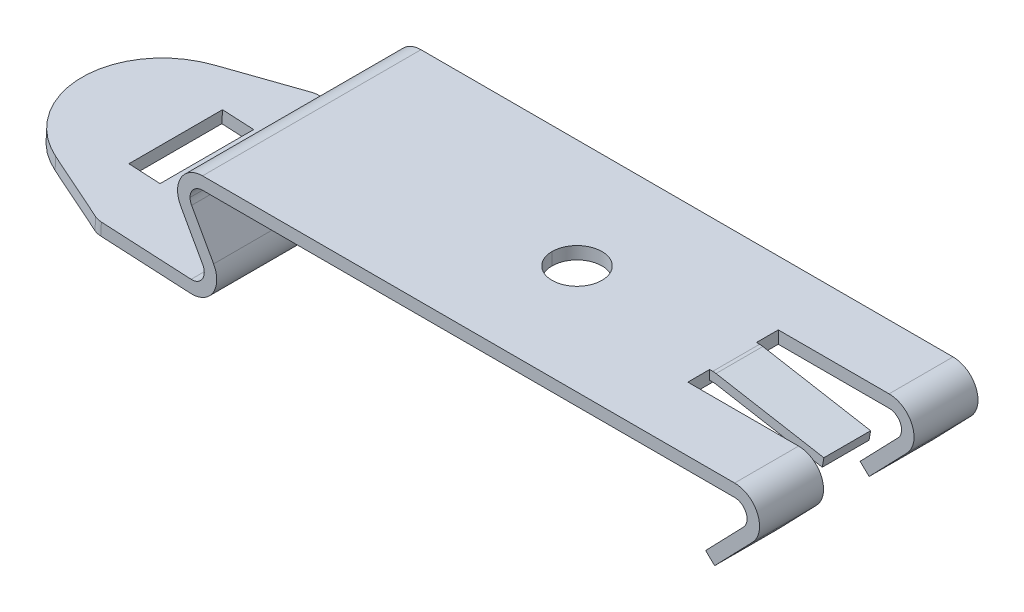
ISO-10303-21;
HEADER;
FILE_DESCRIPTION(('STEP AP214'),'2;1');
FILE_NAME('part.step','',(''),(''),'','','');
FILE_SCHEMA(('AUTOMOTIVE_DESIGN { 1 0 10303 214 1 1 1 1 }'));
ENDSEC;
DATA;
#1=APPLICATION_CONTEXT('core data for automotive mechanical design processes');
#2=APPLICATION_PROTOCOL_DEFINITION('international standard','automotive_design',2000,#1);
#3=PRODUCT_CONTEXT('',#1,'mechanical');
#4=PRODUCT('Part','Part','',(#3));
#5=PRODUCT_RELATED_PRODUCT_CATEGORY('part','',(#4));
#6=PRODUCT_DEFINITION_FORMATION('','',#4);
#7=PRODUCT_DEFINITION_CONTEXT('part definition',#1,'design');
#8=PRODUCT_DEFINITION('design','',#6,#7);
#9=PRODUCT_DEFINITION_SHAPE('','',#8);
#10=(LENGTH_UNIT() NAMED_UNIT(*) SI_UNIT(.MILLI.,.METRE.));
#11=(NAMED_UNIT(*) PLANE_ANGLE_UNIT() SI_UNIT($,.RADIAN.));
#12=(NAMED_UNIT(*) SI_UNIT($,.STERADIAN.) SOLID_ANGLE_UNIT());
#13=UNCERTAINTY_MEASURE_WITH_UNIT(LENGTH_MEASURE(1.E-05),#10,'distance_accuracy_value','');
#14=(GEOMETRIC_REPRESENTATION_CONTEXT(3) GLOBAL_UNCERTAINTY_ASSIGNED_CONTEXT((#13)) GLOBAL_UNIT_ASSIGNED_CONTEXT((#10,
#11,#12)) REPRESENTATION_CONTEXT('',''));
#15=CARTESIAN_POINT('',(0.,0.,0.));
#16=DIRECTION('',(0.,0.,1.));
#17=DIRECTION('',(1.,0.,0.));
#18=AXIS2_PLACEMENT_3D('',#15,#16,#17);
#19=CARTESIAN_POINT('',(0.,2.39041375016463,7.));
#20=DIRECTION('',(0.,1.,0.));
#21=DIRECTION('',(-1.,0.,0.));
#22=AXIS2_PLACEMENT_3D('',#19,#20,#21);
#23=CYLINDRICAL_SURFACE('',#22,1.6);
#24=DIRECTION('',(0.,1.,0.));
#25=VECTOR('',#24,1.);
#26=CARTESIAN_POINT('',(1.60000000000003,2.39041375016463,7.));
#27=LINE('',#26,#25);
#28=CARTESIAN_POINT('',(1.60000000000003,8.5,7.));
#29=VERTEX_POINT('',#28);
#30=CARTESIAN_POINT('',(1.6,9.3,7.));
#31=VERTEX_POINT('',#30);
#32=EDGE_CURVE('E866',#29,#31,#27,.T.);
#33=ORIENTED_EDGE('',*,*,#32,.F.);
#34=CARTESIAN_POINT('',(0.,8.5,7.));
#35=DIRECTION('',(0.,-1.,0.));
#36=DIRECTION('',(-1.,0.,0.));
#37=AXIS2_PLACEMENT_3D('',#34,#35,#36);
#38=CIRCLE('',#37,1.6);
#39=CARTESIAN_POINT('',(-1.59999999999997,8.5,7.));
#40=VERTEX_POINT('',#39);
#41=EDGE_CURVE('E747',#29,#40,#38,.T.);
#42=ORIENTED_EDGE('',*,*,#41,.T.);
#43=DIRECTION('',(0.,1.,0.));
#44=VECTOR('',#43,1.);
#45=CARTESIAN_POINT('',(-1.59999999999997,2.39041375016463,7.));
#46=LINE('',#45,#44);
#47=CARTESIAN_POINT('',(-1.6,9.3,7.));
#48=VERTEX_POINT('',#47);
#49=EDGE_CURVE('E865',#40,#48,#46,.T.);
#50=ORIENTED_EDGE('',*,*,#49,.T.);
#51=CARTESIAN_POINT('',(0.,9.3,7.));
#52=DIRECTION('',(0.,1.,0.));
#53=DIRECTION('',(-1.,0.,0.));
#54=AXIS2_PLACEMENT_3D('',#51,#52,#53);
#55=CIRCLE('',#54,1.6);
#56=EDGE_CURVE('E683',#48,#31,#55,.T.);
#57=ORIENTED_EDGE('',*,*,#56,.T.);
#58=EDGE_LOOP('',(#33,#42,#50,#57));
#59=FACE_BOUND('',#58,.T.);
#60=ADVANCED_FACE('F15',(#59),#23,.F.);
#61=CARTESIAN_POINT('',(-26.2426114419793,-6.37509757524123,10.));
#62=DIRECTION('',(0.,0.,1.));
#63=DIRECTION('',(0.,-1.,0.));
#64=AXIS2_PLACEMENT_3D('',#61,#62,#63);
#65=PLANE('',#64);
#66=DIRECTION('',(0.0523359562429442,0.998629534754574,0.));
#67=VECTOR('',#66,1.);
#68=CARTESIAN_POINT('',(-26.2426114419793,-6.37509757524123,10.));
#69=LINE('',#68,#67);
#70=CARTESIAN_POINT('',(-25.7611206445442,2.81229414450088,10.));
#71=VERTEX_POINT('',#70);
#72=CARTESIAN_POINT('',(-25.7192518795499,3.61119777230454,10.));
#73=VERTEX_POINT('',#72);
#74=EDGE_CURVE('E762',#71,#73,#69,.T.);
#75=ORIENTED_EDGE('',*,*,#74,.T.);
#76=DIRECTION('',(0.998629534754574,-0.0523359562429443,0.));
#77=VECTOR('',#76,1.);
#78=CARTESIAN_POINT('',(-25.7192518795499,3.61119777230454,10.));
#79=LINE('',#78,#77);
#80=CARTESIAN_POINT('',(-23.7219928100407,3.50652585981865,10.));
#81=VERTEX_POINT('',#80);
#82=EDGE_CURVE('E430',#73,#81,#79,.T.);
#83=ORIENTED_EDGE('',*,*,#82,.T.);
#84=DIRECTION('',(0.0523359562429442,0.998629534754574,0.));
#85=VECTOR('',#84,1.);
#86=CARTESIAN_POINT('',(-24.2453523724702,-6.4797694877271,10.));
#87=LINE('',#86,#85);
#88=CARTESIAN_POINT('',(-23.7638615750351,2.70762223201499,10.));
#89=VERTEX_POINT('',#88);
#90=EDGE_CURVE('E10',#89,#81,#87,.T.);
#91=ORIENTED_EDGE('',*,*,#90,.F.);
#92=DIRECTION('',(0.998629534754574,-0.0523359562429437,0.));
#93=VECTOR('',#92,1.);
#94=CARTESIAN_POINT('',(-17.7720843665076,2.39360649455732,10.));
#95=LINE('',#94,#93);
#96=EDGE_CURVE('E542',#71,#89,#95,.T.);
#97=ORIENTED_EDGE('',*,*,#96,.F.);
#98=EDGE_LOOP('',(#75,#83,#91,#97));
#99=FACE_BOUND('',#98,.T.);
#100=ADVANCED_FACE('F1004',(#99),#65,.F.);
#101=CARTESIAN_POINT('',(-24.2453523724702,-6.47976948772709,4.));
#102=DIRECTION('',(0.998629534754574,-0.0523359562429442,0.));
#103=DIRECTION('',(0.,0.,-1.));
#104=AXIS2_PLACEMENT_3D('',#101,#102,#103);
#105=PLANE('',#104);
#106=ORIENTED_EDGE('',*,*,#90,.T.);
#107=DIRECTION('',(0.,0.,-1.));
#108=VECTOR('',#107,1.);
#109=CARTESIAN_POINT('',(-23.7219928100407,3.50652585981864,4.));
#110=LINE('',#109,#108);
#111=CARTESIAN_POINT('',(-23.7219928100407,3.50652585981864,4.));
#112=VERTEX_POINT('',#111);
#113=EDGE_CURVE('E461',#81,#112,#110,.T.);
#114=ORIENTED_EDGE('',*,*,#113,.T.);
#115=DIRECTION('',(0.0523359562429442,0.998629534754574,0.));
#116=VECTOR('',#115,1.);
#117=CARTESIAN_POINT('',(-24.2453523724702,-6.47976948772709,4.));
#118=LINE('',#117,#116);
#119=CARTESIAN_POINT('',(-23.7638615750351,2.70762223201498,4.));
#120=VERTEX_POINT('',#119);
#121=EDGE_CURVE('E24',#120,#112,#118,.T.);
#122=ORIENTED_EDGE('',*,*,#121,.F.);
#123=DIRECTION('',(0.,0.,-1.));
#124=VECTOR('',#123,1.);
#125=CARTESIAN_POINT('',(-23.7638615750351,2.70762223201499,14.));
#126=LINE('',#125,#124);
#127=EDGE_CURVE('E546',#89,#120,#126,.T.);
#128=ORIENTED_EDGE('',*,*,#127,.F.);
#129=EDGE_LOOP('',(#106,#114,#122,#128));
#130=FACE_BOUND('',#129,.T.);
#131=ADVANCED_FACE('F775',(#130),#105,.F.);
#132=CARTESIAN_POINT('',(-26.2426114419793,-6.37509757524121,4.));
#133=DIRECTION('',(0.,0.,-1.));
#134=DIRECTION('',(0.,-1.,0.));
#135=AXIS2_PLACEMENT_3D('',#132,#133,#134);
#136=PLANE('',#135);
#137=ORIENTED_EDGE('',*,*,#121,.T.);
#138=DIRECTION('',(-0.998629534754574,0.0523359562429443,0.));
#139=VECTOR('',#138,1.);
#140=CARTESIAN_POINT('',(-25.7192518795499,3.61119777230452,4.));
#141=LINE('',#140,#139);
#142=CARTESIAN_POINT('',(-25.7192518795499,3.61119777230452,4.));
#143=VERTEX_POINT('',#142);
#144=EDGE_CURVE('E448',#112,#143,#141,.T.);
#145=ORIENTED_EDGE('',*,*,#144,.T.);
#146=DIRECTION('',(0.0523359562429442,0.998629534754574,0.));
#147=VECTOR('',#146,1.);
#148=CARTESIAN_POINT('',(-26.2426114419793,-6.37509757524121,4.));
#149=LINE('',#148,#147);
#150=CARTESIAN_POINT('',(-25.7611206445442,2.81229414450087,4.));
#151=VERTEX_POINT('',#150);
#152=EDGE_CURVE('E564',#151,#143,#149,.T.);
#153=ORIENTED_EDGE('',*,*,#152,.F.);
#154=DIRECTION('',(-0.998629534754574,0.0523359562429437,0.));
#155=VECTOR('',#154,1.);
#156=CARTESIAN_POINT('',(-17.7720843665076,2.39360649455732,4.));
#157=LINE('',#156,#155);
#158=EDGE_CURVE('E530',#120,#151,#157,.T.);
#159=ORIENTED_EDGE('',*,*,#158,.F.);
#160=EDGE_LOOP('',(#137,#145,#153,#159));
#161=FACE_BOUND('',#160,.T.);
#162=ADVANCED_FACE('F768',(#161),#136,.F.);
#163=CARTESIAN_POINT('',(-26.2426114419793,-6.37509757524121,4.));
#164=DIRECTION('',(-0.998629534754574,0.0523359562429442,0.));
#165=DIRECTION('',(0.,0.,1.));
#166=AXIS2_PLACEMENT_3D('',#163,#164,#165);
#167=PLANE('',#166);
#168=ORIENTED_EDGE('',*,*,#152,.T.);
#169=DIRECTION('',(0.,0.,1.));
#170=VECTOR('',#169,1.);
#171=CARTESIAN_POINT('',(-25.7192518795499,3.61119777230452,4.));
#172=LINE('',#171,#170);
#173=EDGE_CURVE('E434',#143,#73,#172,.T.);
#174=ORIENTED_EDGE('',*,*,#173,.T.);
#175=ORIENTED_EDGE('',*,*,#74,.F.);
#176=DIRECTION('',(0.,0.,1.));
#177=VECTOR('',#176,1.);
#178=CARTESIAN_POINT('',(-25.7611206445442,2.81229414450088,14.));
#179=LINE('',#178,#177);
#180=EDGE_CURVE('E534',#151,#71,#179,.T.);
#181=ORIENTED_EDGE('',*,*,#180,.F.);
#182=EDGE_LOOP('',(#168,#174,#175,#181));
#183=FACE_BOUND('',#182,.T.);
#184=ADVANCED_FACE('F781',(#183),#167,.F.);
#185=CARTESIAN_POINT('',(-23.4038177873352,4.99190953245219,1.2));
#186=DIRECTION('',(0.0523359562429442,0.998629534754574,0.));
#187=DIRECTION('',(-0.998629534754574,0.0523359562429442,0.));
#188=AXIS2_PLACEMENT_3D('',#185,#186,#187);
#189=CYLINDRICAL_SURFACE('',#188,1.2);
#190=CARTESIAN_POINT('',(-23.4823217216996,3.49396523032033,1.20000000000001));
#191=DIRECTION('',(0.0523359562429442,0.998629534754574,0.));
#192=DIRECTION('',(0.998629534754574,-0.0523359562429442,0.));
#193=AXIS2_PLACEMENT_3D('',#190,#191,#192);
#194=CIRCLE('',#193,1.2);
#195=CARTESIAN_POINT('',(-23.4823217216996,3.49396523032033,0.));
#196=VERTEX_POINT('',#195);
#197=CARTESIAN_POINT('',(-23.9432276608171,3.51812028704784,0.0923076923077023));
#198=VERTEX_POINT('',#197);
#199=EDGE_CURVE('E410',#196,#198,#194,.T.);
#200=ORIENTED_EDGE('',*,*,#199,.F.);
#201=DIRECTION('',(0.0523359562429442,0.998629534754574,0.));
#202=VECTOR('',#201,1.);
#203=CARTESIAN_POINT('',(-23.4823217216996,3.49396523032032,0.));
#204=LINE('',#203,#202);
#205=CARTESIAN_POINT('',(-23.524190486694,2.69506160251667,0.));
#206=VERTEX_POINT('',#205);
#207=EDGE_CURVE('E633',#206,#196,#204,.T.);
#208=ORIENTED_EDGE('',*,*,#207,.F.);
#209=CARTESIAN_POINT('',(-23.524190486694,2.69506160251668,1.20000000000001));
#210=DIRECTION('',(-0.0523359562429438,-0.998629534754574,0.));
#211=DIRECTION('',(-0.998629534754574,0.0523359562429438,0.));
#212=AXIS2_PLACEMENT_3D('',#209,#210,#211);
#213=CIRCLE('',#212,1.2);
#214=CARTESIAN_POINT('',(-23.9850964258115,2.71921665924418,0.0923076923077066));
#215=VERTEX_POINT('',#214);
#216=EDGE_CURVE('E506',#215,#206,#213,.T.);
#217=ORIENTED_EDGE('',*,*,#216,.F.);
#218=DIRECTION('',(-0.0523359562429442,-0.998629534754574,0.));
#219=VECTOR('',#218,1.);
#220=CARTESIAN_POINT('',(-23.9850964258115,2.71921665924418,0.0923076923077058));
#221=LINE('',#220,#219);
#222=EDGE_CURVE('E561',#198,#215,#221,.T.);
#223=ORIENTED_EDGE('',*,*,#222,.F.);
#224=EDGE_LOOP('',(#200,#208,#217,#223));
#225=FACE_BOUND('',#224,.T.);
#226=ADVANCED_FACE('F934',(#225),#189,.T.);
#227=CARTESIAN_POINT('',(-23.1513394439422,9.8094833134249,12.8));
#228=DIRECTION('',(-0.0523359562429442,-0.998629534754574,0.));
#229=DIRECTION('',(0.998629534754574,-0.0523359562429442,0.));
#230=AXIS2_PLACEMENT_3D('',#227,#228,#229);
#231=CYLINDRICAL_SURFACE('',#230,1.2);
#232=CARTESIAN_POINT('',(-23.4823217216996,3.49396523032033,12.8));
#233=DIRECTION('',(0.0523359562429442,0.998629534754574,0.));
#234=DIRECTION('',(0.998629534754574,-0.0523359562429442,0.));
#235=AXIS2_PLACEMENT_3D('',#232,#233,#234);
#236=CIRCLE('',#235,1.2);
#237=CARTESIAN_POINT('',(-23.9432276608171,3.51812028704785,13.9076923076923));
#238=VERTEX_POINT('',#237);
#239=CARTESIAN_POINT('',(-23.4823217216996,3.49396523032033,14.));
#240=VERTEX_POINT('',#239);
#241=EDGE_CURVE('E803',#238,#240,#236,.T.);
#242=ORIENTED_EDGE('',*,*,#241,.F.);
#243=DIRECTION('',(0.0523359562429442,0.998629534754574,0.));
#244=VECTOR('',#243,1.);
#245=CARTESIAN_POINT('',(-23.8647237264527,5.01606458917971,13.9076923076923));
#246=LINE('',#245,#244);
#247=CARTESIAN_POINT('',(-23.9850964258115,2.71921665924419,13.9076923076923));
#248=VERTEX_POINT('',#247);
#249=EDGE_CURVE('E565',#248,#238,#246,.T.);
#250=ORIENTED_EDGE('',*,*,#249,.F.);
#251=CARTESIAN_POINT('',(-23.524190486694,2.69506160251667,12.8));
#252=DIRECTION('',(-0.0523359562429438,-0.998629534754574,0.));
#253=DIRECTION('',(-0.998629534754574,0.0523359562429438,0.));
#254=AXIS2_PLACEMENT_3D('',#251,#252,#253);
#255=CIRCLE('',#254,1.2);
#256=CARTESIAN_POINT('',(-23.524190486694,2.69506160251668,14.));
#257=VERTEX_POINT('',#256);
#258=EDGE_CURVE('E479',#257,#248,#255,.T.);
#259=ORIENTED_EDGE('',*,*,#258,.F.);
#260=DIRECTION('',(-0.0523359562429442,-0.998629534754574,0.));
#261=VECTOR('',#260,1.);
#262=CARTESIAN_POINT('',(-23.1513394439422,9.8094833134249,14.));
#263=LINE('',#262,#261);
#264=EDGE_CURVE('E552',#240,#257,#263,.T.);
#265=ORIENTED_EDGE('',*,*,#264,.F.);
#266=EDGE_LOOP('',(#242,#250,#259,#265));
#267=FACE_BOUND('',#266,.T.);
#268=ADVANCED_FACE('F983',(#267),#231,.T.);
#269=CARTESIAN_POINT('',(-23.6434888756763,5.0044701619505,0.));
#270=DIRECTION('',(-0.384088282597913,0.0201292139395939,-0.923076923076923));
#271=DIRECTION('',(-0.923263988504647,0.,0.384166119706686));
#272=AXIS2_PLACEMENT_3D('',#269,#270,#271);
#273=PLANE('',#272);
#274=DIRECTION('',(0.921811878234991,-0.0483101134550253,-0.384615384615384));
#275=VECTOR('',#274,1.);
#276=CARTESIAN_POINT('',(-35.4928214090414,4.12340884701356,4.91124260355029));
#277=LINE('',#276,#275);
#278=CARTESIAN_POINT('',(-28.3310522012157,3.74807642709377,1.92307692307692));
#279=VERTEX_POINT('',#278);
#280=EDGE_CURVE('E415',#279,#198,#277,.T.);
#281=ORIENTED_EDGE('',*,*,#280,.T.);
#282=ORIENTED_EDGE('',*,*,#222,.T.);
#283=DIRECTION('',(-0.921811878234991,0.0483101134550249,0.384615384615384));
#284=VECTOR('',#283,1.);
#285=CARTESIAN_POINT('',(-23.6220443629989,2.70018990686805,-0.0591715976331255));
#286=LINE('',#285,#284);
#287=CARTESIAN_POINT('',(-28.3729209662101,2.94917279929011,1.92307692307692));
#288=VERTEX_POINT('',#287);
#289=EDGE_CURVE('E496',#215,#288,#286,.T.);
#290=ORIENTED_EDGE('',*,*,#289,.T.);
#291=DIRECTION('',(-0.0523359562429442,-0.998629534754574,0.));
#292=VECTOR('',#291,1.);
#293=CARTESIAN_POINT('',(-28.2525482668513,5.24602072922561,1.92307692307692));
#294=LINE('',#293,#292);
#295=EDGE_CURVE('E720',#279,#288,#294,.T.);
#296=ORIENTED_EDGE('',*,*,#295,.F.);
#297=EDGE_LOOP('',(#281,#282,#290,#296));
#298=FACE_BOUND('',#297,.T.);
#299=ADVANCED_FACE('F1047',(#298),#273,.T.);
#300=CARTESIAN_POINT('',(-28.2525482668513,5.24602072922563,12.0769230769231));
#301=DIRECTION('',(-0.384088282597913,0.0201292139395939,0.923076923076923));
#302=DIRECTION('',(0.0523359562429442,0.998629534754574,0.));
#303=AXIS2_PLACEMENT_3D('',#300,#301,#302);
#304=PLANE('',#303);
#305=DIRECTION('',(0.921811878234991,-0.0483101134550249,0.384615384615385));
#306=VECTOR('',#305,1.);
#307=CARTESIAN_POINT('',(-18.6584419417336,2.4400585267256,16.130177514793));
#308=LINE('',#307,#306);
#309=CARTESIAN_POINT('',(-28.3729209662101,2.94917279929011,12.0769230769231));
#310=VERTEX_POINT('',#309);
#311=EDGE_CURVE('E488',#310,#248,#308,.T.);
#312=ORIENTED_EDGE('',*,*,#311,.T.);
#313=ORIENTED_EDGE('',*,*,#249,.T.);
#314=DIRECTION('',(-0.921811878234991,0.0483101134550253,-0.384615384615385));
#315=VECTOR('',#314,1.);
#316=CARTESIAN_POINT('',(-30.529218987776,3.86327746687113,11.1597633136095));
#317=LINE('',#316,#315);
#318=CARTESIAN_POINT('',(-28.3310522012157,3.74807642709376,12.0769230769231));
#319=VERTEX_POINT('',#318);
#320=EDGE_CURVE('E808',#238,#319,#317,.T.);
#321=ORIENTED_EDGE('',*,*,#320,.T.);
#322=DIRECTION('',(-0.0523359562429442,-0.998629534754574,0.));
#323=VECTOR('',#322,1.);
#324=CARTESIAN_POINT('',(-28.2525482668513,5.24602072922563,12.0769230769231));
#325=LINE('',#324,#323);
#326=EDGE_CURVE('E723',#319,#310,#325,.T.);
#327=ORIENTED_EDGE('',*,*,#326,.T.);
#328=EDGE_LOOP('',(#312,#313,#321,#327));
#329=FACE_BOUND('',#328,.T.);
#330=ADVANCED_FACE('F845',(#329),#304,.T.);
#331=CARTESIAN_POINT('',(-26.1400627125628,5.13531005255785,7.));
#332=DIRECTION('',(-0.0523359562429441,-0.998629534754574,0.));
#333=DIRECTION('',(0.998629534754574,-0.0523359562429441,0.));
#334=AXIS2_PLACEMENT_3D('',#331,#332,#333);
#335=CYLINDRICAL_SURFACE('',#334,5.5);
#336=CARTESIAN_POINT('',(-26.2185666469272,3.637365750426,7.));
#337=DIRECTION('',(-0.0523359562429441,-0.998629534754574,0.));
#338=DIRECTION('',(0.998629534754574,-0.0523359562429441,0.));
#339=AXIS2_PLACEMENT_3D('',#336,#337,#338);
#340=CIRCLE('',#339,5.5);
#341=EDGE_CURVE('E426',#319,#279,#340,.T.);
#342=ORIENTED_EDGE('',*,*,#341,.T.);
#343=ORIENTED_EDGE('',*,*,#295,.T.);
#344=CARTESIAN_POINT('',(-26.2604354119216,2.83846212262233,7.));
#345=DIRECTION('',(0.0523359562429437,0.998629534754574,0.));
#346=DIRECTION('',(-0.998629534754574,0.0523359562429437,0.));
#347=AXIS2_PLACEMENT_3D('',#344,#345,#346);
#348=CIRCLE('',#347,5.5);
#349=EDGE_CURVE('E492',#288,#310,#348,.T.);
#350=ORIENTED_EDGE('',*,*,#349,.T.);
#351=ORIENTED_EDGE('',*,*,#326,.F.);
#352=EDGE_LOOP('',(#342,#343,#350,#351));
#353=FACE_BOUND('',#352,.T.);
#354=ADVANCED_FACE('F851',(#353),#335,.T.);
#355=CARTESIAN_POINT('',(10.2713428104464,8.1,8.5));
#356=DIRECTION('',(0.,0.,1.));
#357=DIRECTION('',(0.,-1.,0.));
#358=AXIS2_PLACEMENT_3D('',#355,#356,#357);
#359=PLANE('',#358);
#360=DIRECTION('',(0.984807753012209,-0.173648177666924,0.));
#361=VECTOR('',#360,1.);
#362=CARTESIAN_POINT('',(17.2174902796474,7.48446275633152,8.5));
#363=LINE('',#362,#361);
#364=CARTESIAN_POINT('',(10.3755317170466,8.69088465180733,8.5));
#365=VERTEX_POINT('',#364);
#366=CARTESIAN_POINT('',(17.2174902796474,7.48446275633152,8.5));
#367=VERTEX_POINT('',#366);
#368=EDGE_CURVE('E501',#365,#367,#363,.T.);
#369=ORIENTED_EDGE('',*,*,#368,.T.);
#370=DIRECTION('',(0.173648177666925,0.984807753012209,0.));
#371=VECTOR('',#370,1.);
#372=CARTESIAN_POINT('',(17.3195279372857,8.06314706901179,8.5));
#373=LINE('',#372,#371);
#374=CARTESIAN_POINT('',(17.3195279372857,8.06314706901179,8.5));
#375=VERTEX_POINT('',#374);
#376=EDGE_CURVE('E376',#367,#375,#373,.T.);
#377=ORIENTED_EDGE('',*,*,#376,.T.);
#378=DIRECTION('',(-0.984807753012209,0.173648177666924,0.));
#379=VECTOR('',#378,1.);
#380=CARTESIAN_POINT('',(10.4083778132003,9.28176930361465,8.5));
#381=LINE('',#380,#379);
#382=CARTESIAN_POINT('',(10.4083778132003,9.28176930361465,8.5));
#383=VERTEX_POINT('',#382);
#384=EDGE_CURVE('E369',#375,#383,#381,.T.);
#385=ORIENTED_EDGE('',*,*,#384,.T.);
#386=CARTESIAN_POINT('',(10.2,8.1,8.5));
#387=DIRECTION('',(0.,0.,1.));
#388=DIRECTION('',(-1.,0.,0.));
#389=AXIS2_PLACEMENT_3D('',#386,#387,#388);
#390=CIRCLE('',#389,1.2);
#391=CARTESIAN_POINT('',(10.2,9.3,8.5));
#392=VERTEX_POINT('',#391);
#393=EDGE_CURVE('E374',#383,#392,#390,.T.);
#394=ORIENTED_EDGE('',*,*,#393,.T.);
#395=DIRECTION('',(-1.,0.,0.));
#396=VECTOR('',#395,1.);
#397=CARTESIAN_POINT('',(10.2,9.3,8.5));
#398=LINE('',#397,#396);
#399=CARTESIAN_POINT('',(10.,9.3,8.5));
#400=VERTEX_POINT('',#399);
#401=EDGE_CURVE('E507',#392,#400,#398,.T.);
#402=ORIENTED_EDGE('',*,*,#401,.T.);
#403=DIRECTION('',(0.,-1.,0.));
#404=VECTOR('',#403,1.);
#405=CARTESIAN_POINT('',(10.,9.3,8.5));
#406=LINE('',#405,#404);
#407=CARTESIAN_POINT('',(10.,8.7,8.5));
#408=VERTEX_POINT('',#407);
#409=EDGE_CURVE('E467',#400,#408,#406,.T.);
#410=ORIENTED_EDGE('',*,*,#409,.T.);
#411=DIRECTION('',(1.,0.,0.));
#412=VECTOR('',#411,1.);
#413=CARTESIAN_POINT('',(10.,8.7,8.5));
#414=LINE('',#413,#412);
#415=CARTESIAN_POINT('',(10.2713428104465,8.7,8.5));
#416=VERTEX_POINT('',#415);
#417=EDGE_CURVE('E402',#408,#416,#414,.T.);
#418=ORIENTED_EDGE('',*,*,#417,.T.);
#419=CARTESIAN_POINT('',(10.2713428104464,8.1,8.5));
#420=DIRECTION('',(0.,0.,-1.));
#421=DIRECTION('',(1.,0.,0.));
#422=AXIS2_PLACEMENT_3D('',#419,#420,#421);
#423=CIRCLE('',#422,0.6);
#424=EDGE_CURVE('E651',#416,#365,#423,.T.);
#425=ORIENTED_EDGE('',*,*,#424,.T.);
#426=EDGE_LOOP('',(#369,#377,#385,#394,#402,#410,#418,#425));
#427=FACE_BOUND('',#426,.T.);
#428=ADVANCED_FACE('F372',(#427),#359,.T.);
#429=CARTESIAN_POINT('',(10.2713428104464,8.1,5.5));
#430=DIRECTION('',(0.,0.,1.));
#431=DIRECTION('',(0.,-1.,0.));
#432=AXIS2_PLACEMENT_3D('',#429,#430,#431);
#433=PLANE('',#432);
#434=DIRECTION('',(0.984807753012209,-0.173648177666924,0.));
#435=VECTOR('',#434,1.);
#436=CARTESIAN_POINT('',(17.2174902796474,7.48446275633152,5.5));
#437=LINE('',#436,#435);
#438=CARTESIAN_POINT('',(10.3755317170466,8.69088465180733,5.5));
#439=VERTEX_POINT('',#438);
#440=CARTESIAN_POINT('',(17.2174902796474,7.48446275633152,5.5));
#441=VERTEX_POINT('',#440);
#442=EDGE_CURVE('E622',#439,#441,#437,.T.);
#443=ORIENTED_EDGE('',*,*,#442,.F.);
#444=CARTESIAN_POINT('',(10.2713428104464,8.1,5.5));
#445=DIRECTION('',(0.,0.,-1.));
#446=DIRECTION('',(1.,0.,0.));
#447=AXIS2_PLACEMENT_3D('',#444,#445,#446);
#448=CIRCLE('',#447,0.6);
#449=CARTESIAN_POINT('',(10.2713428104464,8.7,5.5));
#450=VERTEX_POINT('',#449);
#451=EDGE_CURVE('E449',#450,#439,#448,.T.);
#452=ORIENTED_EDGE('',*,*,#451,.F.);
#453=DIRECTION('',(1.,0.,0.));
#454=VECTOR('',#453,1.);
#455=CARTESIAN_POINT('',(10.,8.7,5.5));
#456=LINE('',#455,#454);
#457=CARTESIAN_POINT('',(10.,8.7,5.5));
#458=VERTEX_POINT('',#457);
#459=EDGE_CURVE('E396',#458,#450,#456,.T.);
#460=ORIENTED_EDGE('',*,*,#459,.F.);
#461=DIRECTION('',(0.,-1.,0.));
#462=VECTOR('',#461,1.);
#463=CARTESIAN_POINT('',(10.,9.3,5.5));
#464=LINE('',#463,#462);
#465=CARTESIAN_POINT('',(10.,9.3,5.5));
#466=VERTEX_POINT('',#465);
#467=EDGE_CURVE('E551',#466,#458,#464,.T.);
#468=ORIENTED_EDGE('',*,*,#467,.F.);
#469=DIRECTION('',(-1.,0.,0.));
#470=VECTOR('',#469,1.);
#471=CARTESIAN_POINT('',(10.2,9.3,5.5));
#472=LINE('',#471,#470);
#473=CARTESIAN_POINT('',(10.2,9.3,5.5));
#474=VERTEX_POINT('',#473);
#475=EDGE_CURVE('E519',#474,#466,#472,.T.);
#476=ORIENTED_EDGE('',*,*,#475,.F.);
#477=CARTESIAN_POINT('',(10.2,8.1,5.5));
#478=DIRECTION('',(0.,0.,1.));
#479=DIRECTION('',(-1.,0.,0.));
#480=AXIS2_PLACEMENT_3D('',#477,#478,#479);
#481=CIRCLE('',#480,1.2);
#482=CARTESIAN_POINT('',(10.4083778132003,9.28176930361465,5.5));
#483=VERTEX_POINT('',#482);
#484=EDGE_CURVE('E381',#483,#474,#481,.T.);
#485=ORIENTED_EDGE('',*,*,#484,.F.);
#486=DIRECTION('',(-0.984807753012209,0.173648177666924,0.));
#487=VECTOR('',#486,1.);
#488=CARTESIAN_POINT('',(10.4083778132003,9.28176930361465,5.5));
#489=LINE('',#488,#487);
#490=CARTESIAN_POINT('',(17.3195279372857,8.06314706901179,5.5));
#491=VERTEX_POINT('',#490);
#492=EDGE_CURVE('E386',#491,#483,#489,.T.);
#493=ORIENTED_EDGE('',*,*,#492,.F.);
#494=DIRECTION('',(0.173648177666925,0.984807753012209,0.));
#495=VECTOR('',#494,1.);
#496=CARTESIAN_POINT('',(17.3195279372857,8.06314706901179,5.5));
#497=LINE('',#496,#495);
#498=EDGE_CURVE('E36',#441,#491,#497,.T.);
#499=ORIENTED_EDGE('',*,*,#498,.F.);
#500=EDGE_LOOP('',(#443,#452,#460,#468,#476,#485,#493,#499));
#501=FACE_BOUND('',#500,.T.);
#502=ADVANCED_FACE('F1081',(#501),#433,.F.);
#503=CARTESIAN_POINT('',(17.3195279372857,8.06314706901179,5.5));
#504=DIRECTION('',(0.984807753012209,-0.173648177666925,0.));
#505=DIRECTION('',(0.,0.,-1.));
#506=AXIS2_PLACEMENT_3D('',#503,#504,#505);
#507=PLANE('',#506);
#508=DIRECTION('',(0.,0.,1.));
#509=VECTOR('',#508,1.);
#510=CARTESIAN_POINT('',(17.3195279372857,8.06314706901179,5.5));
#511=LINE('',#510,#509);
#512=EDGE_CURVE('E380',#491,#375,#511,.T.);
#513=ORIENTED_EDGE('',*,*,#512,.T.);
#514=ORIENTED_EDGE('',*,*,#376,.F.);
#515=DIRECTION('',(0.,0.,1.));
#516=VECTOR('',#515,1.);
#517=CARTESIAN_POINT('',(17.2174902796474,7.48446275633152,5.5));
#518=LINE('',#517,#516);
#519=EDGE_CURVE('E497',#441,#367,#518,.T.);
#520=ORIENTED_EDGE('',*,*,#519,.F.);
#521=ORIENTED_EDGE('',*,*,#498,.T.);
#522=EDGE_LOOP('',(#513,#514,#520,#521));
#523=FACE_BOUND('',#522,.T.);
#524=ADVANCED_FACE('F1090',(#523),#507,.T.);
#525=CARTESIAN_POINT('',(10.4083778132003,9.28176930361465,5.5));
#526=DIRECTION('',(0.173648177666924,0.984807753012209,0.));
#527=DIRECTION('',(0.,0.,-1.));
#528=AXIS2_PLACEMENT_3D('',#525,#526,#527);
#529=PLANE('',#528);
#530=DIRECTION('',(0.,0.,1.));
#531=VECTOR('',#530,1.);
#532=CARTESIAN_POINT('',(10.4083778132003,9.28176930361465,5.5));
#533=LINE('',#532,#531);
#534=EDGE_CURVE('E384',#483,#383,#533,.T.);
#535=ORIENTED_EDGE('',*,*,#534,.T.);
#536=ORIENTED_EDGE('',*,*,#384,.F.);
#537=ORIENTED_EDGE('',*,*,#512,.F.);
#538=ORIENTED_EDGE('',*,*,#492,.T.);
#539=EDGE_LOOP('',(#535,#536,#537,#538));
#540=FACE_BOUND('',#539,.T.);
#541=ADVANCED_FACE('F385',(#540),#529,.T.);
#542=CARTESIAN_POINT('',(10.2,8.1,5.5));
#543=DIRECTION('',(0.,0.,1.));
#544=DIRECTION('',(1.,0.,0.));
#545=AXIS2_PLACEMENT_3D('',#542,#543,#544);
#546=CYLINDRICAL_SURFACE('',#545,1.2);
#547=DIRECTION('',(0.,0.,1.));
#548=VECTOR('',#547,1.);
#549=CARTESIAN_POINT('',(10.2,9.3,5.5));
#550=LINE('',#549,#548);
#551=EDGE_CURVE('E393',#474,#392,#550,.T.);
#552=ORIENTED_EDGE('',*,*,#551,.T.);
#553=ORIENTED_EDGE('',*,*,#393,.F.);
#554=ORIENTED_EDGE('',*,*,#534,.F.);
#555=ORIENTED_EDGE('',*,*,#484,.T.);
#556=EDGE_LOOP('',(#552,#553,#554,#555));
#557=FACE_BOUND('',#556,.T.);
#558=ADVANCED_FACE('F391',(#557),#546,.T.);
#559=CARTESIAN_POINT('',(10.,8.7,5.5));
#560=DIRECTION('',(0.,-1.,0.));
#561=DIRECTION('',(0.,0.,-1.));
#562=AXIS2_PLACEMENT_3D('',#559,#560,#561);
#563=PLANE('',#562);
#564=DIRECTION('',(0.,0.,1.));
#565=VECTOR('',#564,1.);
#566=CARTESIAN_POINT('',(10.2713428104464,8.7,5.5));
#567=LINE('',#566,#565);
#568=EDGE_CURVE('E453',#450,#416,#567,.T.);
#569=ORIENTED_EDGE('',*,*,#568,.T.);
#570=ORIENTED_EDGE('',*,*,#417,.F.);
#571=DIRECTION('',(0.,0.,1.));
#572=VECTOR('',#571,1.);
#573=CARTESIAN_POINT('',(10.,8.7,5.5));
#574=LINE('',#573,#572);
#575=EDGE_CURVE('E547',#458,#408,#574,.T.);
#576=ORIENTED_EDGE('',*,*,#575,.F.);
#577=ORIENTED_EDGE('',*,*,#459,.T.);
#578=EDGE_LOOP('',(#569,#570,#576,#577));
#579=FACE_BOUND('',#578,.T.);
#580=ADVANCED_FACE('F1116',(#579),#563,.T.);
#581=CARTESIAN_POINT('',(10.2713428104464,8.1,5.5));
#582=DIRECTION('',(0.,0.,1.));
#583=DIRECTION('',(1.,0.,0.));
#584=AXIS2_PLACEMENT_3D('',#581,#582,#583);
#585=CYLINDRICAL_SURFACE('',#584,0.6);
#586=DIRECTION('',(0.,0.,1.));
#587=VECTOR('',#586,1.);
#588=CARTESIAN_POINT('',(10.3755317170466,8.69088465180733,5.5));
#589=LINE('',#588,#587);
#590=EDGE_CURVE('E618',#439,#365,#589,.T.);
#591=ORIENTED_EDGE('',*,*,#590,.T.);
#592=ORIENTED_EDGE('',*,*,#424,.F.);
#593=ORIENTED_EDGE('',*,*,#568,.F.);
#594=ORIENTED_EDGE('',*,*,#451,.T.);
#595=EDGE_LOOP('',(#591,#592,#593,#594));
#596=FACE_BOUND('',#595,.T.);
#597=ADVANCED_FACE('F1125',(#596),#585,.F.);
#598=CARTESIAN_POINT('',(17.2174902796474,7.48446275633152,5.5));
#599=DIRECTION('',(-0.173648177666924,-0.984807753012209,0.));
#600=DIRECTION('',(-0.984807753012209,0.173648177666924,0.));
#601=AXIS2_PLACEMENT_3D('',#598,#599,#600);
#602=PLANE('',#601);
#603=ORIENTED_EDGE('',*,*,#519,.T.);
#604=ORIENTED_EDGE('',*,*,#368,.F.);
#605=ORIENTED_EDGE('',*,*,#590,.F.);
#606=ORIENTED_EDGE('',*,*,#442,.T.);
#607=EDGE_LOOP('',(#603,#604,#605,#606));
#608=FACE_BOUND('',#607,.T.);
#609=ADVANCED_FACE('F1135',(#608),#602,.T.);
#610=CARTESIAN_POINT('',(10.,23.3,4.1));
#611=DIRECTION('',(0.,0.,1.));
#612=DIRECTION('',(0.,-1.,0.));
#613=AXIS2_PLACEMENT_3D('',#610,#611,#612);
#614=PLANE('',#613);
#615=DIRECTION('',(-1.,0.,0.));
#616=VECTOR('',#615,1.);
#617=CARTESIAN_POINT('',(17.1,9.3,4.1));
#618=LINE('',#617,#616);
#619=CARTESIAN_POINT('',(17.1,9.3,4.1));
#620=VERTEX_POINT('',#619);
#621=CARTESIAN_POINT('',(10.,9.3,4.1));
#622=VERTEX_POINT('',#621);
#623=EDGE_CURVE('E526',#620,#622,#618,.T.);
#624=ORIENTED_EDGE('',*,*,#623,.T.);
#625=DIRECTION('',(0.,-1.,0.));
#626=VECTOR('',#625,1.);
#627=CARTESIAN_POINT('',(10.,23.3,4.1));
#628=LINE('',#627,#626);
#629=CARTESIAN_POINT('',(10.,8.5,4.1));
#630=VERTEX_POINT('',#629);
#631=EDGE_CURVE('E694',#622,#630,#628,.T.);
#632=ORIENTED_EDGE('',*,*,#631,.T.);
#633=DIRECTION('',(1.,0.,0.));
#634=VECTOR('',#633,1.);
#635=CARTESIAN_POINT('',(17.1,8.5,4.1));
#636=LINE('',#635,#634);
#637=CARTESIAN_POINT('',(17.1,8.5,4.1));
#638=VERTEX_POINT('',#637);
#639=EDGE_CURVE('E744',#630,#638,#636,.T.);
#640=ORIENTED_EDGE('',*,*,#639,.T.);
#641=CARTESIAN_POINT('',(17.1,7.7,4.1));
#642=DIRECTION('',(0.,0.,-1.));
#643=DIRECTION('',(1.,0.,0.));
#644=AXIS2_PLACEMENT_3D('',#641,#642,#643);
#645=CIRCLE('',#644,0.8);
#646=CARTESIAN_POINT('',(17.6754718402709,7.1442733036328,4.1));
#647=VERTEX_POINT('',#646);
#648=EDGE_CURVE('E707',#638,#647,#645,.T.);
#649=ORIENTED_EDGE('',*,*,#648,.T.);
#650=DIRECTION('',(-0.694658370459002,-0.719339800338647,0.));
#651=VECTOR('',#650,1.);
#652=CARTESIAN_POINT('',(15.2441675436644,4.62658400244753,4.1));
#653=LINE('',#652,#651);
#654=CARTESIAN_POINT('',(15.2441675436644,4.62658400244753,4.1));
#655=VERTEX_POINT('',#654);
#656=EDGE_CURVE('E439',#647,#655,#653,.T.);
#657=ORIENTED_EDGE('',*,*,#656,.T.);
#658=DIRECTION('',(0.719339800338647,-0.694658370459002,0.));
#659=VECTOR('',#658,1.);
#660=CARTESIAN_POINT('',(15.2441675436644,4.62658400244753,4.1));
#661=LINE('',#660,#659);
#662=CARTESIAN_POINT('',(15.8196393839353,4.07085730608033,4.1));
#663=VERTEX_POINT('',#662);
#664=EDGE_CURVE('E719',#655,#663,#661,.T.);
#665=ORIENTED_EDGE('',*,*,#664,.T.);
#666=DIRECTION('',(0.694658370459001,0.719339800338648,0.));
#667=VECTOR('',#666,1.);
#668=CARTESIAN_POINT('',(15.8196393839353,4.07085730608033,4.1));
#669=LINE('',#668,#667);
#670=CARTESIAN_POINT('',(18.2509436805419,6.58854660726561,4.1));
#671=VERTEX_POINT('',#670);
#672=EDGE_CURVE('E658',#663,#671,#669,.T.);
#673=ORIENTED_EDGE('',*,*,#672,.T.);
#674=CARTESIAN_POINT('',(17.1,7.7,4.1));
#675=DIRECTION('',(0.,0.,1.));
#676=DIRECTION('',(1.,0.,0.));
#677=AXIS2_PLACEMENT_3D('',#674,#675,#676);
#678=CIRCLE('',#677,1.6);
#679=EDGE_CURVE('E538',#671,#620,#678,.T.);
#680=ORIENTED_EDGE('',*,*,#679,.T.);
#681=EDGE_LOOP('',(#624,#632,#640,#649,#657,#665,#673,#680));
#682=FACE_BOUND('',#681,.T.);
#683=ADVANCED_FACE('F899',(#682),#614,.T.);
#684=CARTESIAN_POINT('',(10.,23.3,9.9));
#685=DIRECTION('',(0.,0.,-1.));
#686=DIRECTION('',(0.,-1.,0.));
#687=AXIS2_PLACEMENT_3D('',#684,#685,#686);
#688=PLANE('',#687);
#689=DIRECTION('',(1.,0.,0.));
#690=VECTOR('',#689,1.);
#691=CARTESIAN_POINT('',(17.1,9.3,9.9));
#692=LINE('',#691,#690);
#693=CARTESIAN_POINT('',(10.,9.3,9.9));
#694=VERTEX_POINT('',#693);
#695=CARTESIAN_POINT('',(17.1,9.3,9.9));
#696=VERTEX_POINT('',#695);
#697=EDGE_CURVE('E510',#694,#696,#692,.T.);
#698=ORIENTED_EDGE('',*,*,#697,.T.);
#699=CARTESIAN_POINT('',(17.1,7.7,9.9));
#700=DIRECTION('',(0.,0.,-1.));
#701=DIRECTION('',(-1.,0.,0.));
#702=AXIS2_PLACEMENT_3D('',#699,#700,#701);
#703=CIRCLE('',#702,1.6);
#704=CARTESIAN_POINT('',(18.2509436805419,6.5885466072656,9.9));
#705=VERTEX_POINT('',#704);
#706=EDGE_CURVE('E418',#696,#705,#703,.T.);
#707=ORIENTED_EDGE('',*,*,#706,.T.);
#708=DIRECTION('',(-0.694658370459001,-0.719339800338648,0.));
#709=VECTOR('',#708,1.);
#710=CARTESIAN_POINT('',(15.8196393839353,4.07085730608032,9.9));
#711=LINE('',#710,#709);
#712=CARTESIAN_POINT('',(15.8196393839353,4.07085730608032,9.9));
#713=VERTEX_POINT('',#712);
#714=EDGE_CURVE('E728',#705,#713,#711,.T.);
#715=ORIENTED_EDGE('',*,*,#714,.T.);
#716=DIRECTION('',(-0.719339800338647,0.694658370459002,0.));
#717=VECTOR('',#716,1.);
#718=CARTESIAN_POINT('',(15.2441675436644,4.62658400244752,9.9));
#719=LINE('',#718,#717);
#720=CARTESIAN_POINT('',(15.2441675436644,4.62658400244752,9.9));
#721=VERTEX_POINT('',#720);
#722=EDGE_CURVE('E438',#713,#721,#719,.T.);
#723=ORIENTED_EDGE('',*,*,#722,.T.);
#724=DIRECTION('',(0.694658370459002,0.719339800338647,0.));
#725=VECTOR('',#724,1.);
#726=CARTESIAN_POINT('',(15.2441675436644,4.62658400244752,9.9));
#727=LINE('',#726,#725);
#728=CARTESIAN_POINT('',(17.6754718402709,7.14427330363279,9.9));
#729=VERTEX_POINT('',#728);
#730=EDGE_CURVE('E483',#721,#729,#727,.T.);
#731=ORIENTED_EDGE('',*,*,#730,.T.);
#732=CARTESIAN_POINT('',(17.1,7.7,9.9));
#733=DIRECTION('',(0.,0.,1.));
#734=DIRECTION('',(-1.,0.,0.));
#735=AXIS2_PLACEMENT_3D('',#732,#733,#734);
#736=CIRCLE('',#735,0.8);
#737=CARTESIAN_POINT('',(17.1,8.5,9.9));
#738=VERTEX_POINT('',#737);
#739=EDGE_CURVE('E698',#729,#738,#736,.T.);
#740=ORIENTED_EDGE('',*,*,#739,.T.);
#741=DIRECTION('',(-1.,0.,0.));
#742=VECTOR('',#741,1.);
#743=CARTESIAN_POINT('',(17.1,8.5,9.9));
#744=LINE('',#743,#742);
#745=CARTESIAN_POINT('',(10.,8.5,9.9));
#746=VERTEX_POINT('',#745);
#747=EDGE_CURVE('E690',#738,#746,#744,.T.);
#748=ORIENTED_EDGE('',*,*,#747,.T.);
#749=DIRECTION('',(0.,-1.,0.));
#750=VECTOR('',#749,1.);
#751=CARTESIAN_POINT('',(10.,23.3,9.9));
#752=LINE('',#751,#750);
#753=EDGE_CURVE('E466',#694,#746,#752,.T.);
#754=ORIENTED_EDGE('',*,*,#753,.F.);
#755=EDGE_LOOP('',(#698,#707,#715,#723,#731,#740,#748,#754));
#756=FACE_BOUND('',#755,.T.);
#757=ADVANCED_FACE('F969',(#756),#688,.T.);
#758=CARTESIAN_POINT('',(-17.,7.7,14.));
#759=DIRECTION('',(0.,0.,-1.));
#760=DIRECTION('',(-1.,0.,0.));
#761=AXIS2_PLACEMENT_3D('',#758,#759,#760);
#762=CYLINDRICAL_SURFACE('',#761,0.8);
#763=DIRECTION('',(0.,0.,-1.));
#764=VECTOR('',#763,1.);
#765=CARTESIAN_POINT('',(-17.8,7.7,14.));
#766=LINE('',#765,#764);
#767=CARTESIAN_POINT('',(-17.8,7.7,14.));
#768=VERTEX_POINT('',#767);
#769=CARTESIAN_POINT('',(-17.8,7.7,0.));
#770=VERTEX_POINT('',#769);
#771=EDGE_CURVE('E796',#768,#770,#766,.T.);
#772=ORIENTED_EDGE('',*,*,#771,.F.);
#773=CARTESIAN_POINT('',(-17.,7.7,14.));
#774=DIRECTION('',(0.,0.,-1.));
#775=DIRECTION('',(-1.,0.,0.));
#776=AXIS2_PLACEMENT_3D('',#773,#774,#775);
#777=CIRCLE('',#776,0.8);
#778=CARTESIAN_POINT('',(-17.6996957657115,7.31215230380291,14.));
#779=VERTEX_POINT('',#778);
#780=EDGE_CURVE('E560',#779,#768,#777,.T.);
#781=ORIENTED_EDGE('',*,*,#780,.F.);
#782=DIRECTION('',(0.,0.,-1.));
#783=VECTOR('',#782,1.);
#784=CARTESIAN_POINT('',(-17.6996957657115,7.31215230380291,14.));
#785=LINE('',#784,#783);
#786=CARTESIAN_POINT('',(-17.6996957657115,7.31215230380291,0.));
#787=VERTEX_POINT('',#786);
#788=EDGE_CURVE('E502',#779,#787,#785,.T.);
#789=ORIENTED_EDGE('',*,*,#788,.T.);
#790=CARTESIAN_POINT('',(-17.,7.7,0.));
#791=DIRECTION('',(0.,0.,-1.));
#792=DIRECTION('',(-1.,0.,0.));
#793=AXIS2_PLACEMENT_3D('',#790,#791,#792);
#794=CIRCLE('',#793,0.8);
#795=EDGE_CURVE('E589',#787,#770,#794,.T.);
#796=ORIENTED_EDGE('',*,*,#795,.T.);
#797=EDGE_LOOP('',(#772,#781,#789,#796));
#798=FACE_BOUND('',#797,.T.);
#799=ADVANCED_FACE('F920',(#798),#762,.F.);
#800=CARTESIAN_POINT('',(-17.6996957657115,7.31215230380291,14.));
#801=DIRECTION('',(-0.874619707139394,-0.484809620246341,0.));
#802=DIRECTION('',(-0.484809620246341,0.874619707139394,0.));
#803=AXIS2_PLACEMENT_3D('',#800,#801,#802);
#804=PLANE('',#803);
#805=DIRECTION('',(-0.484809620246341,0.874619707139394,0.));
#806=VECTOR('',#805,1.);
#807=CARTESIAN_POINT('',(-17.6996957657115,7.31215230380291,0.));
#808=LINE('',#807,#806);
#809=CARTESIAN_POINT('',(-16.2889553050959,4.76710914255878,0.));
#810=VERTEX_POINT('',#809);
#811=EDGE_CURVE('E584',#810,#787,#808,.T.);
#812=ORIENTED_EDGE('',*,*,#811,.T.);
#813=ORIENTED_EDGE('',*,*,#788,.F.);
#814=DIRECTION('',(-0.484809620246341,0.874619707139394,0.));
#815=VECTOR('',#814,1.);
#816=CARTESIAN_POINT('',(-17.6996957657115,7.31215230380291,14.));
#817=LINE('',#816,#815);
#818=CARTESIAN_POINT('',(-16.2889553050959,4.76710914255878,14.));
#819=VERTEX_POINT('',#818);
#820=EDGE_CURVE('E556',#819,#779,#817,.T.);
#821=ORIENTED_EDGE('',*,*,#820,.F.);
#822=DIRECTION('',(0.,0.,-1.));
#823=VECTOR('',#822,1.);
#824=CARTESIAN_POINT('',(-16.2889553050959,4.76710914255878,14.));
#825=LINE('',#824,#823);
#826=EDGE_CURVE('E572',#819,#810,#825,.T.);
#827=ORIENTED_EDGE('',*,*,#826,.T.);
#828=EDGE_LOOP('',(#812,#813,#821,#827));
#829=FACE_BOUND('',#828,.T.);
#830=ADVANCED_FACE('F924',(#829),#804,.F.);
#831=CARTESIAN_POINT('',(-17.6883468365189,3.99141375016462,14.));
#832=DIRECTION('',(0.,0.,-1.));
#833=DIRECTION('',(-1.,0.,0.));
#834=AXIS2_PLACEMENT_3D('',#831,#832,#833);
#835=CYLINDRICAL_SURFACE('',#834,1.6);
#836=CARTESIAN_POINT('',(-17.6883468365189,3.99141375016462,0.));
#837=DIRECTION('',(0.,0.,1.));
#838=DIRECTION('',(-1.,0.,0.));
#839=AXIS2_PLACEMENT_3D('',#836,#837,#838);
#840=CIRCLE('',#839,1.6);
#841=CARTESIAN_POINT('',(-17.7720843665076,2.39360649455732,0.));
#842=VERTEX_POINT('',#841);
#843=EDGE_CURVE('E588',#842,#810,#840,.T.);
#844=ORIENTED_EDGE('',*,*,#843,.T.);
#845=ORIENTED_EDGE('',*,*,#826,.F.);
#846=CARTESIAN_POINT('',(-17.6883468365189,3.99141375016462,14.));
#847=DIRECTION('',(0.,0.,1.));
#848=DIRECTION('',(-1.,0.,0.));
#849=AXIS2_PLACEMENT_3D('',#846,#847,#848);
#850=CIRCLE('',#849,1.6);
#851=CARTESIAN_POINT('',(-17.7720843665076,2.39360649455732,14.));
#852=VERTEX_POINT('',#851);
#853=EDGE_CURVE('E555',#852,#819,#850,.T.);
#854=ORIENTED_EDGE('',*,*,#853,.F.);
#855=DIRECTION('',(0.,0.,-1.));
#856=VECTOR('',#855,1.);
#857=CARTESIAN_POINT('',(-17.7720843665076,2.39360649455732,14.));
#858=LINE('',#857,#856);
#859=EDGE_CURVE('E523',#852,#842,#858,.T.);
#860=ORIENTED_EDGE('',*,*,#859,.T.);
#861=EDGE_LOOP('',(#844,#845,#854,#860));
#862=FACE_BOUND('',#861,.T.);
#863=ADVANCED_FACE('F926',(#862),#835,.T.);
#864=CARTESIAN_POINT('',(-17.6883468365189,3.99141375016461,14.));
#865=DIRECTION('',(0.,0.,-1.));
#866=DIRECTION('',(-1.,0.,0.));
#867=AXIS2_PLACEMENT_3D('',#864,#865,#866);
#868=CYLINDRICAL_SURFACE('',#867,0.8);
#869=CARTESIAN_POINT('',(-17.6883468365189,3.99141375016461,0.));
#870=DIRECTION('',(0.,0.,-1.));
#871=DIRECTION('',(1.,0.,0.));
#872=AXIS2_PLACEMENT_3D('',#869,#870,#871);
#873=CIRCLE('',#872,0.8);
#874=CARTESIAN_POINT('',(-16.9886510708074,4.37926144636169,0.));
#875=VERTEX_POINT('',#874);
#876=CARTESIAN_POINT('',(-17.7302156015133,3.19251012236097,0.));
#877=VERTEX_POINT('',#876);
#878=EDGE_CURVE('E636',#875,#877,#873,.T.);
#879=ORIENTED_EDGE('',*,*,#878,.T.);
#880=DIRECTION('',(0.,0.,-1.));
#881=VECTOR('',#880,1.);
#882=CARTESIAN_POINT('',(-17.7302156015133,3.19251012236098,14.));
#883=LINE('',#882,#881);
#884=CARTESIAN_POINT('',(-17.7302156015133,3.19251012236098,14.));
#885=VERTEX_POINT('',#884);
#886=EDGE_CURVE('E406',#885,#877,#883,.T.);
#887=ORIENTED_EDGE('',*,*,#886,.F.);
#888=CARTESIAN_POINT('',(-17.6883468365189,3.99141375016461,14.));
#889=DIRECTION('',(0.,0.,-1.));
#890=DIRECTION('',(1.,0.,0.));
#891=AXIS2_PLACEMENT_3D('',#888,#889,#890);
#892=CIRCLE('',#891,0.8);
#893=CARTESIAN_POINT('',(-16.9886510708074,4.37926144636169,14.));
#894=VERTEX_POINT('',#893);
#895=EDGE_CURVE('E626',#894,#885,#892,.T.);
#896=ORIENTED_EDGE('',*,*,#895,.F.);
#897=DIRECTION('',(0.,0.,-1.));
#898=VECTOR('',#897,1.);
#899=CARTESIAN_POINT('',(-16.9886510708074,4.37926144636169,14.));
#900=LINE('',#899,#898);
#901=EDGE_CURVE('E575',#894,#875,#900,.T.);
#902=ORIENTED_EDGE('',*,*,#901,.T.);
#903=EDGE_LOOP('',(#879,#887,#896,#902));
#904=FACE_BOUND('',#903,.T.);
#905=ADVANCED_FACE('F940',(#904),#868,.F.);
#906=CARTESIAN_POINT('',(-16.9886510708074,4.37926144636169,14.));
#907=DIRECTION('',(0.874619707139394,0.484809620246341,0.));
#908=DIRECTION('',(0.,0.,-1.));
#909=AXIS2_PLACEMENT_3D('',#906,#907,#908);
#910=PLANE('',#909);
#911=DIRECTION('',(0.484809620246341,-0.874619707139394,0.));
#912=VECTOR('',#911,1.);
#913=CARTESIAN_POINT('',(-16.9886510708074,4.37926144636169,0.));
#914=LINE('',#913,#912);
#915=CARTESIAN_POINT('',(-18.399391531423,6.92430460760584,0.));
#916=VERTEX_POINT('',#915);
#917=EDGE_CURVE('E444',#916,#875,#914,.T.);
#918=ORIENTED_EDGE('',*,*,#917,.T.);
#919=ORIENTED_EDGE('',*,*,#901,.F.);
#920=DIRECTION('',(0.484809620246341,-0.874619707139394,0.));
#921=VECTOR('',#920,1.);
#922=CARTESIAN_POINT('',(-16.9886510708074,4.37926144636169,14.));
#923=LINE('',#922,#921);
#924=CARTESIAN_POINT('',(-18.399391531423,6.92430460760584,14.));
#925=VERTEX_POINT('',#924);
#926=EDGE_CURVE('E617',#925,#894,#923,.T.);
#927=ORIENTED_EDGE('',*,*,#926,.F.);
#928=DIRECTION('',(0.,0.,-1.));
#929=VECTOR('',#928,1.);
#930=CARTESIAN_POINT('',(-18.399391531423,6.92430460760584,14.));
#931=LINE('',#930,#929);
#932=EDGE_CURVE('E831',#925,#916,#931,.T.);
#933=ORIENTED_EDGE('',*,*,#932,.T.);
#934=EDGE_LOOP('',(#918,#919,#927,#933));
#935=FACE_BOUND('',#934,.T.);
#936=ADVANCED_FACE('F945',(#935),#910,.F.);
#937=CARTESIAN_POINT('',(-17.,7.7,14.));
#938=DIRECTION('',(0.,0.,-1.));
#939=DIRECTION('',(-1.,0.,0.));
#940=AXIS2_PLACEMENT_3D('',#937,#938,#939);
#941=CYLINDRICAL_SURFACE('',#940,1.6);
#942=DIRECTION('',(0.,0.,-1.));
#943=VECTOR('',#942,1.);
#944=CARTESIAN_POINT('',(-18.6,7.7,14.));
#945=LINE('',#944,#943);
#946=CARTESIAN_POINT('',(-18.6,7.7,14.));
#947=VERTEX_POINT('',#946);
#948=CARTESIAN_POINT('',(-18.6,7.7,0.));
#949=VERTEX_POINT('',#948);
#950=EDGE_CURVE('E826',#947,#949,#945,.T.);
#951=ORIENTED_EDGE('',*,*,#950,.F.);
#952=CARTESIAN_POINT('',(-17.,7.7,14.));
#953=DIRECTION('',(0.,0.,1.));
#954=DIRECTION('',(-1.,0.,0.));
#955=AXIS2_PLACEMENT_3D('',#952,#953,#954);
#956=CIRCLE('',#955,1.6);
#957=CARTESIAN_POINT('',(-17.,9.3,14.));
#958=VERTEX_POINT('',#957);
#959=EDGE_CURVE('E614',#958,#947,#956,.T.);
#960=ORIENTED_EDGE('',*,*,#959,.F.);
#961=DIRECTION('',(0.,0.,-1.));
#962=VECTOR('',#961,1.);
#963=CARTESIAN_POINT('',(-17.,9.3,14.));
#964=LINE('',#963,#962);
#965=CARTESIAN_POINT('',(-17.,9.3,0.));
#966=VERTEX_POINT('',#965);
#967=EDGE_CURVE('E680',#958,#966,#964,.T.);
#968=ORIENTED_EDGE('',*,*,#967,.T.);
#969=CARTESIAN_POINT('',(-17.,7.7,0.));
#970=DIRECTION('',(0.,0.,1.));
#971=DIRECTION('',(-1.,0.,0.));
#972=AXIS2_PLACEMENT_3D('',#969,#970,#971);
#973=CIRCLE('',#972,1.6);
#974=EDGE_CURVE('E440',#966,#949,#973,.T.);
#975=ORIENTED_EDGE('',*,*,#974,.T.);
#976=EDGE_LOOP('',(#951,#960,#968,#975));
#977=FACE_BOUND('',#976,.T.);
#978=ADVANCED_FACE('F953',(#977),#941,.T.);
#979=CARTESIAN_POINT('',(17.1,8.5,14.));
#980=DIRECTION('',(0.,1.,0.));
#981=DIRECTION('',(1.,0.,0.));
#982=AXIS2_PLACEMENT_3D('',#979,#980,#981);
#983=PLANE('',#982);
#984=CARTESIAN_POINT('',(0.,8.5,7.));
#985=DIRECTION('',(0.,-1.,0.));
#986=DIRECTION('',(-1.,0.,0.));
#987=AXIS2_PLACEMENT_3D('',#984,#985,#986);
#988=CIRCLE('',#987,1.6);
#989=EDGE_CURVE('E1494',#40,#29,#988,.T.);
#990=ORIENTED_EDGE('',*,*,#989,.F.);
#991=ORIENTED_EDGE('',*,*,#41,.F.);
#992=EDGE_LOOP('',(#990,#991));
#993=FACE_BOUND('',#992,.T.);
#994=ORIENTED_EDGE('',*,*,#747,.F.);
#995=DIRECTION('',(0.,0.,-1.));
#996=VECTOR('',#995,1.);
#997=CARTESIAN_POINT('',(17.1,8.5,14.));
#998=LINE('',#997,#996);
#999=CARTESIAN_POINT('',(17.1,8.5,14.));
#1000=VERTEX_POINT('',#999);
#1001=EDGE_CURVE('E703',#1000,#738,#998,.T.);
#1002=ORIENTED_EDGE('',*,*,#1001,.F.);
#1003=DIRECTION('',(1.,0.,0.));
#1004=VECTOR('',#1003,1.);
#1005=CARTESIAN_POINT('',(17.1,8.5,14.));
#1006=LINE('',#1005,#1004);
#1007=CARTESIAN_POINT('',(-17.,8.5,14.));
#1008=VERTEX_POINT('',#1007);
#1009=EDGE_CURVE('E571',#1008,#1000,#1006,.T.);
#1010=ORIENTED_EDGE('',*,*,#1009,.F.);
#1011=DIRECTION('',(0.,0.,-1.));
#1012=VECTOR('',#1011,1.);
#1013=CARTESIAN_POINT('',(-17.,8.5,14.));
#1014=LINE('',#1013,#1012);
#1015=CARTESIAN_POINT('',(-17.,8.5,0.));
#1016=VERTEX_POINT('',#1015);
#1017=EDGE_CURVE('E812',#1008,#1016,#1014,.T.);
#1018=ORIENTED_EDGE('',*,*,#1017,.T.);
#1019=DIRECTION('',(1.,0.,0.));
#1020=VECTOR('',#1019,1.);
#1021=CARTESIAN_POINT('',(17.1,8.5,0.));
#1022=LINE('',#1021,#1020);
#1023=CARTESIAN_POINT('',(17.1,8.5,0.));
#1024=VERTEX_POINT('',#1023);
#1025=EDGE_CURVE('E666',#1016,#1024,#1022,.T.);
#1026=ORIENTED_EDGE('',*,*,#1025,.T.);
#1027=DIRECTION('',(0.,0.,-1.));
#1028=VECTOR('',#1027,1.);
#1029=CARTESIAN_POINT('',(17.1,8.5,14.));
#1030=LINE('',#1029,#1028);
#1031=EDGE_CURVE('E484',#638,#1024,#1030,.T.);
#1032=ORIENTED_EDGE('',*,*,#1031,.F.);
#1033=ORIENTED_EDGE('',*,*,#639,.F.);
#1034=DIRECTION('',(0.,0.,-1.));
#1035=VECTOR('',#1034,1.);
#1036=CARTESIAN_POINT('',(10.,8.5,14.));
#1037=LINE('',#1036,#1035);
#1038=EDGE_CURVE('E687',#746,#630,#1037,.T.);
#1039=ORIENTED_EDGE('',*,*,#1038,.F.);
#1040=EDGE_LOOP('',(#994,#1002,#1010,#1018,#1026,#1032,#1033,#1039));
#1041=FACE_BOUND('',#1040,.T.);
#1042=ADVANCED_FACE('F910',(#993,#1041),#983,.F.);
#1043=CARTESIAN_POINT('',(17.1,9.3,14.));
#1044=DIRECTION('',(0.,-1.,0.));
#1045=DIRECTION('',(0.,0.,-1.));
#1046=AXIS2_PLACEMENT_3D('',#1043,#1044,#1045);
#1047=PLANE('',#1046);
#1048=ORIENTED_EDGE('',*,*,#56,.F.);
#1049=CARTESIAN_POINT('',(0.,9.3,7.));
#1050=DIRECTION('',(0.,1.,0.));
#1051=DIRECTION('',(-1.,0.,0.));
#1052=AXIS2_PLACEMENT_3D('',#1049,#1050,#1051);
#1053=CIRCLE('',#1052,1.6);
#1054=EDGE_CURVE('E862',#31,#48,#1053,.T.);
#1055=ORIENTED_EDGE('',*,*,#1054,.F.);
#1056=EDGE_LOOP('',(#1048,#1055));
#1057=FACE_BOUND('',#1056,.T.);
#1058=ORIENTED_EDGE('',*,*,#697,.F.);
#1059=DIRECTION('',(0.,0.,1.));
#1060=VECTOR('',#1059,1.);
#1061=CARTESIAN_POINT('',(10.,9.3,14.));
#1062=LINE('',#1061,#1060);
#1063=EDGE_CURVE('E462',#400,#694,#1062,.T.);
#1064=ORIENTED_EDGE('',*,*,#1063,.F.);
#1065=ORIENTED_EDGE('',*,*,#401,.F.);
#1066=ORIENTED_EDGE('',*,*,#551,.F.);
#1067=ORIENTED_EDGE('',*,*,#475,.T.);
#1068=DIRECTION('',(0.,0.,1.));
#1069=VECTOR('',#1068,1.);
#1070=CARTESIAN_POINT('',(10.,9.3,14.));
#1071=LINE('',#1070,#1069);
#1072=EDGE_CURVE('E601',#622,#466,#1071,.T.);
#1073=ORIENTED_EDGE('',*,*,#1072,.F.);
#1074=ORIENTED_EDGE('',*,*,#623,.F.);
#1075=DIRECTION('',(0.,0.,-1.));
#1076=VECTOR('',#1075,1.);
#1077=CARTESIAN_POINT('',(17.1,9.3,14.));
#1078=LINE('',#1077,#1076);
#1079=CARTESIAN_POINT('',(17.1,9.3,0.));
#1080=VERTEX_POINT('',#1079);
#1081=EDGE_CURVE('E593',#620,#1080,#1078,.T.);
#1082=ORIENTED_EDGE('',*,*,#1081,.T.);
#1083=DIRECTION('',(-1.,0.,0.));
#1084=VECTOR('',#1083,1.);
#1085=CARTESIAN_POINT('',(17.1,9.3,0.));
#1086=LINE('',#1085,#1084);
#1087=EDGE_CURVE('E443',#1080,#966,#1086,.T.);
#1088=ORIENTED_EDGE('',*,*,#1087,.T.);
#1089=ORIENTED_EDGE('',*,*,#967,.F.);
#1090=DIRECTION('',(-1.,0.,0.));
#1091=VECTOR('',#1090,1.);
#1092=CARTESIAN_POINT('',(17.1,9.3,14.));
#1093=LINE('',#1092,#1091);
#1094=CARTESIAN_POINT('',(17.1,9.3,14.));
#1095=VERTEX_POINT('',#1094);
#1096=EDGE_CURVE('E610',#1095,#958,#1093,.T.);
#1097=ORIENTED_EDGE('',*,*,#1096,.F.);
#1098=DIRECTION('',(0.,0.,-1.));
#1099=VECTOR('',#1098,1.);
#1100=CARTESIAN_POINT('',(17.1,9.3,14.));
#1101=LINE('',#1100,#1099);
#1102=EDGE_CURVE('E421',#1095,#696,#1101,.T.);
#1103=ORIENTED_EDGE('',*,*,#1102,.T.);
#1104=EDGE_LOOP('',(#1058,#1064,#1065,#1066,#1067,#1073,#1074,#1082,#1088,#1089,#1097,#1103));
#1105=FACE_BOUND('',#1104,.T.);
#1106=ADVANCED_FACE('F957',(#1057,#1105),#1047,.F.);
#1107=CARTESIAN_POINT('',(17.1,7.7,14.));
#1108=DIRECTION('',(0.,0.,-1.));
#1109=DIRECTION('',(-1.,0.,0.));
#1110=AXIS2_PLACEMENT_3D('',#1107,#1108,#1109);
#1111=CYLINDRICAL_SURFACE('',#1110,1.6);
#1112=ORIENTED_EDGE('',*,*,#679,.F.);
#1113=DIRECTION('',(0.,0.,-1.));
#1114=VECTOR('',#1113,1.);
#1115=CARTESIAN_POINT('',(18.2509436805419,6.5885466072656,14.));
#1116=LINE('',#1115,#1114);
#1117=CARTESIAN_POINT('',(18.2509436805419,6.5885466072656,0.));
#1118=VERTEX_POINT('',#1117);
#1119=EDGE_CURVE('E422',#671,#1118,#1116,.T.);
#1120=ORIENTED_EDGE('',*,*,#1119,.T.);
#1121=CARTESIAN_POINT('',(17.1,7.7,0.));
#1122=DIRECTION('',(0.,0.,1.));
#1123=DIRECTION('',(-1.,0.,0.));
#1124=AXIS2_PLACEMENT_3D('',#1121,#1122,#1123);
#1125=CIRCLE('',#1124,1.6);
#1126=EDGE_CURVE('E457',#1118,#1080,#1125,.T.);
#1127=ORIENTED_EDGE('',*,*,#1126,.T.);
#1128=ORIENTED_EDGE('',*,*,#1081,.F.);
#1129=EDGE_LOOP('',(#1112,#1120,#1127,#1128));
#1130=FACE_BOUND('',#1129,.T.);
#1131=ADVANCED_FACE('F897',(#1130),#1111,.T.);
#1132=CARTESIAN_POINT('',(17.1,7.7,14.));
#1133=DIRECTION('',(0.,0.,-1.));
#1134=DIRECTION('',(-1.,0.,0.));
#1135=AXIS2_PLACEMENT_3D('',#1132,#1133,#1134);
#1136=CYLINDRICAL_SURFACE('',#1135,1.6);
#1137=ORIENTED_EDGE('',*,*,#706,.F.);
#1138=ORIENTED_EDGE('',*,*,#1102,.F.);
#1139=CARTESIAN_POINT('',(17.1,7.7,14.));
#1140=DIRECTION('',(0.,0.,1.));
#1141=DIRECTION('',(-1.,0.,0.));
#1142=AXIS2_PLACEMENT_3D('',#1139,#1140,#1141);
#1143=CIRCLE('',#1142,1.6);
#1144=CARTESIAN_POINT('',(18.2509436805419,6.5885466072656,14.));
#1145=VERTEX_POINT('',#1144);
#1146=EDGE_CURVE('E606',#1145,#1095,#1143,.T.);
#1147=ORIENTED_EDGE('',*,*,#1146,.F.);
#1148=DIRECTION('',(0.,0.,-1.));
#1149=VECTOR('',#1148,1.);
#1150=CARTESIAN_POINT('',(18.2509436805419,6.5885466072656,14.));
#1151=LINE('',#1150,#1149);
#1152=EDGE_CURVE('E731',#1145,#705,#1151,.T.);
#1153=ORIENTED_EDGE('',*,*,#1152,.T.);
#1154=EDGE_LOOP('',(#1137,#1138,#1147,#1153));
#1155=FACE_BOUND('',#1154,.T.);
#1156=ADVANCED_FACE('F1236',(#1155),#1136,.T.);
#1157=CARTESIAN_POINT('',(15.8196393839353,4.07085730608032,14.));
#1158=DIRECTION('',(-0.719339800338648,0.694658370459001,0.));
#1159=DIRECTION('',(0.,0.,1.));
#1160=AXIS2_PLACEMENT_3D('',#1157,#1158,#1159);
#1161=PLANE('',#1160);
#1162=ORIENTED_EDGE('',*,*,#672,.F.);
#1163=DIRECTION('',(0.,0.,-1.));
#1164=VECTOR('',#1163,1.);
#1165=CARTESIAN_POINT('',(15.8196393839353,4.07085730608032,14.));
#1166=LINE('',#1165,#1164);
#1167=CARTESIAN_POINT('',(15.8196393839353,4.07085730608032,0.));
#1168=VERTEX_POINT('',#1167);
#1169=EDGE_CURVE('E727',#663,#1168,#1166,.T.);
#1170=ORIENTED_EDGE('',*,*,#1169,.T.);
#1171=DIRECTION('',(0.694658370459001,0.719339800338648,0.));
#1172=VECTOR('',#1171,1.);
#1173=CARTESIAN_POINT('',(15.8196393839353,4.07085730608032,0.));
#1174=LINE('',#1173,#1172);
#1175=EDGE_CURVE('E471',#1168,#1118,#1174,.T.);
#1176=ORIENTED_EDGE('',*,*,#1175,.T.);
#1177=ORIENTED_EDGE('',*,*,#1119,.F.);
#1178=EDGE_LOOP('',(#1162,#1170,#1176,#1177));
#1179=FACE_BOUND('',#1178,.T.);
#1180=ADVANCED_FACE('F881',(#1179),#1161,.F.);
#1181=CARTESIAN_POINT('',(15.8196393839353,4.07085730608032,14.));
#1182=DIRECTION('',(-0.719339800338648,0.694658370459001,0.));
#1183=DIRECTION('',(0.,0.,1.));
#1184=AXIS2_PLACEMENT_3D('',#1181,#1182,#1183);
#1185=PLANE('',#1184);
#1186=ORIENTED_EDGE('',*,*,#714,.F.);
#1187=ORIENTED_EDGE('',*,*,#1152,.F.);
#1188=DIRECTION('',(0.694658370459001,0.719339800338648,0.));
#1189=VECTOR('',#1188,1.);
#1190=CARTESIAN_POINT('',(15.8196393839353,4.07085730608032,14.));
#1191=LINE('',#1190,#1189);
#1192=CARTESIAN_POINT('',(15.8196393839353,4.07085730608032,14.));
#1193=VERTEX_POINT('',#1192);
#1194=EDGE_CURVE('E602',#1193,#1145,#1191,.T.);
#1195=ORIENTED_EDGE('',*,*,#1194,.F.);
#1196=DIRECTION('',(0.,0.,-1.));
#1197=VECTOR('',#1196,1.);
#1198=CARTESIAN_POINT('',(15.8196393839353,4.07085730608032,14.));
#1199=LINE('',#1198,#1197);
#1200=EDGE_CURVE('E568',#1193,#713,#1199,.T.);
#1201=ORIENTED_EDGE('',*,*,#1200,.T.);
#1202=EDGE_LOOP('',(#1186,#1187,#1195,#1201));
#1203=FACE_BOUND('',#1202,.T.);
#1204=ADVANCED_FACE('F1280',(#1203),#1185,.F.);
#1205=CARTESIAN_POINT('',(15.2441675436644,4.62658400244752,14.));
#1206=DIRECTION('',(0.694658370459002,0.719339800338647,0.));
#1207=DIRECTION('',(0.,0.,-1.));
#1208=AXIS2_PLACEMENT_3D('',#1205,#1206,#1207);
#1209=PLANE('',#1208);
#1210=ORIENTED_EDGE('',*,*,#664,.F.);
#1211=DIRECTION('',(0.,0.,-1.));
#1212=VECTOR('',#1211,1.);
#1213=CARTESIAN_POINT('',(15.2441675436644,4.62658400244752,14.));
#1214=LINE('',#1213,#1212);
#1215=CARTESIAN_POINT('',(15.2441675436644,4.62658400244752,0.));
#1216=VERTEX_POINT('',#1215);
#1217=EDGE_CURVE('E435',#655,#1216,#1214,.T.);
#1218=ORIENTED_EDGE('',*,*,#1217,.T.);
#1219=DIRECTION('',(0.719339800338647,-0.694658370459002,0.));
#1220=VECTOR('',#1219,1.);
#1221=CARTESIAN_POINT('',(15.2441675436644,4.62658400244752,0.));
#1222=LINE('',#1221,#1220);
#1223=EDGE_CURVE('E647',#1216,#1168,#1222,.T.);
#1224=ORIENTED_EDGE('',*,*,#1223,.T.);
#1225=ORIENTED_EDGE('',*,*,#1169,.F.);
#1226=EDGE_LOOP('',(#1210,#1218,#1224,#1225));
#1227=FACE_BOUND('',#1226,.T.);
#1228=ADVANCED_FACE('F887',(#1227),#1209,.F.);
#1229=CARTESIAN_POINT('',(15.2441675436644,4.62658400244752,14.));
#1230=DIRECTION('',(0.694658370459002,0.719339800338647,0.));
#1231=DIRECTION('',(0.,0.,-1.));
#1232=AXIS2_PLACEMENT_3D('',#1229,#1230,#1231);
#1233=PLANE('',#1232);
#1234=ORIENTED_EDGE('',*,*,#722,.F.);
#1235=ORIENTED_EDGE('',*,*,#1200,.F.);
#1236=DIRECTION('',(0.719339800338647,-0.694658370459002,0.));
#1237=VECTOR('',#1236,1.);
#1238=CARTESIAN_POINT('',(15.2441675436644,4.62658400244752,14.));
#1239=LINE('',#1238,#1237);
#1240=CARTESIAN_POINT('',(15.2441675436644,4.62658400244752,14.));
#1241=VERTEX_POINT('',#1240);
#1242=EDGE_CURVE('E597',#1241,#1193,#1239,.T.);
#1243=ORIENTED_EDGE('',*,*,#1242,.F.);
#1244=DIRECTION('',(0.,0.,-1.));
#1245=VECTOR('',#1244,1.);
#1246=CARTESIAN_POINT('',(15.2441675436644,4.62658400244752,14.));
#1247=LINE('',#1246,#1245);
#1248=EDGE_CURVE('E627',#1241,#721,#1247,.T.);
#1249=ORIENTED_EDGE('',*,*,#1248,.T.);
#1250=EDGE_LOOP('',(#1234,#1235,#1243,#1249));
#1251=FACE_BOUND('',#1250,.T.);
#1252=ADVANCED_FACE('F1242',(#1251),#1233,.F.);
#1253=CARTESIAN_POINT('',(15.2441675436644,4.62658400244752,14.));
#1254=DIRECTION('',(0.719339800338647,-0.694658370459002,0.));
#1255=DIRECTION('',(0.,0.,-1.));
#1256=AXIS2_PLACEMENT_3D('',#1253,#1254,#1255);
#1257=PLANE('',#1256);
#1258=ORIENTED_EDGE('',*,*,#656,.F.);
#1259=DIRECTION('',(0.,0.,-1.));
#1260=VECTOR('',#1259,1.);
#1261=CARTESIAN_POINT('',(17.6754718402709,7.14427330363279,14.));
#1262=LINE('',#1261,#1260);
#1263=CARTESIAN_POINT('',(17.6754718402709,7.14427330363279,0.));
#1264=VERTEX_POINT('',#1263);
#1265=EDGE_CURVE('E480',#647,#1264,#1262,.T.);
#1266=ORIENTED_EDGE('',*,*,#1265,.T.);
#1267=DIRECTION('',(-0.694658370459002,-0.719339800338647,0.));
#1268=VECTOR('',#1267,1.);
#1269=CARTESIAN_POINT('',(15.2441675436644,4.62658400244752,0.));
#1270=LINE('',#1269,#1268);
#1271=EDGE_CURVE('E655',#1264,#1216,#1270,.T.);
#1272=ORIENTED_EDGE('',*,*,#1271,.T.);
#1273=ORIENTED_EDGE('',*,*,#1217,.F.);
#1274=EDGE_LOOP('',(#1258,#1266,#1272,#1273));
#1275=FACE_BOUND('',#1274,.T.);
#1276=ADVANCED_FACE('F901',(#1275),#1257,.F.);
#1277=CARTESIAN_POINT('',(15.2441675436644,4.62658400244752,14.));
#1278=DIRECTION('',(0.719339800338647,-0.694658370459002,0.));
#1279=DIRECTION('',(0.,0.,-1.));
#1280=AXIS2_PLACEMENT_3D('',#1277,#1278,#1279);
#1281=PLANE('',#1280);
#1282=ORIENTED_EDGE('',*,*,#730,.F.);
#1283=ORIENTED_EDGE('',*,*,#1248,.F.);
#1284=DIRECTION('',(-0.694658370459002,-0.719339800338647,0.));
#1285=VECTOR('',#1284,1.);
#1286=CARTESIAN_POINT('',(15.2441675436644,4.62658400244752,14.));
#1287=LINE('',#1286,#1285);
#1288=CARTESIAN_POINT('',(17.6754718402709,7.14427330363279,14.));
#1289=VERTEX_POINT('',#1288);
#1290=EDGE_CURVE('E583',#1289,#1241,#1287,.T.);
#1291=ORIENTED_EDGE('',*,*,#1290,.F.);
#1292=DIRECTION('',(0.,0.,-1.));
#1293=VECTOR('',#1292,1.);
#1294=CARTESIAN_POINT('',(17.6754718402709,7.14427330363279,14.));
#1295=LINE('',#1294,#1293);
#1296=EDGE_CURVE('E699',#1289,#729,#1295,.T.);
#1297=ORIENTED_EDGE('',*,*,#1296,.T.);
#1298=EDGE_LOOP('',(#1282,#1283,#1291,#1297));
#1299=FACE_BOUND('',#1298,.T.);
#1300=ADVANCED_FACE('F974',(#1299),#1281,.F.);
#1301=CARTESIAN_POINT('',(17.1,7.7,14.));
#1302=DIRECTION('',(0.,0.,-1.));
#1303=DIRECTION('',(-1.,0.,0.));
#1304=AXIS2_PLACEMENT_3D('',#1301,#1302,#1303);
#1305=CYLINDRICAL_SURFACE('',#1304,0.8);
#1306=ORIENTED_EDGE('',*,*,#648,.F.);
#1307=ORIENTED_EDGE('',*,*,#1031,.T.);
#1308=CARTESIAN_POINT('',(17.1,7.7,0.));
#1309=DIRECTION('',(0.,0.,-1.));
#1310=DIRECTION('',(1.,0.,0.));
#1311=AXIS2_PLACEMENT_3D('',#1308,#1309,#1310);
#1312=CIRCLE('',#1311,0.8);
#1313=EDGE_CURVE('E662',#1024,#1264,#1312,.T.);
#1314=ORIENTED_EDGE('',*,*,#1313,.T.);
#1315=ORIENTED_EDGE('',*,*,#1265,.F.);
#1316=EDGE_LOOP('',(#1306,#1307,#1314,#1315));
#1317=FACE_BOUND('',#1316,.T.);
#1318=ADVANCED_FACE('F907',(#1317),#1305,.F.);
#1319=CARTESIAN_POINT('',(17.1,7.7,14.));
#1320=DIRECTION('',(0.,0.,-1.));
#1321=DIRECTION('',(-1.,0.,0.));
#1322=AXIS2_PLACEMENT_3D('',#1319,#1320,#1321);
#1323=CYLINDRICAL_SURFACE('',#1322,0.8);
#1324=ORIENTED_EDGE('',*,*,#739,.F.);
#1325=ORIENTED_EDGE('',*,*,#1296,.F.);
#1326=CARTESIAN_POINT('',(17.1,7.7,14.));
#1327=DIRECTION('',(0.,0.,-1.));
#1328=DIRECTION('',(1.,0.,0.));
#1329=AXIS2_PLACEMENT_3D('',#1326,#1327,#1328);
#1330=CIRCLE('',#1329,0.8);
#1331=EDGE_CURVE('E579',#1000,#1289,#1330,.T.);
#1332=ORIENTED_EDGE('',*,*,#1331,.F.);
#1333=ORIENTED_EDGE('',*,*,#1001,.T.);
#1334=EDGE_LOOP('',(#1324,#1325,#1332,#1333));
#1335=FACE_BOUND('',#1334,.T.);
#1336=ADVANCED_FACE('F968',(#1335),#1323,.F.);
#1337=CARTESIAN_POINT('',(10.,23.3,4.1));
#1338=DIRECTION('',(1.,0.,0.));
#1339=DIRECTION('',(0.,1.,0.));
#1340=AXIS2_PLACEMENT_3D('',#1337,#1338,#1339);
#1341=PLANE('',#1340);
#1342=ORIENTED_EDGE('',*,*,#1072,.T.);
#1343=ORIENTED_EDGE('',*,*,#467,.T.);
#1344=ORIENTED_EDGE('',*,*,#575,.T.);
#1345=ORIENTED_EDGE('',*,*,#409,.F.);
#1346=ORIENTED_EDGE('',*,*,#1063,.T.);
#1347=ORIENTED_EDGE('',*,*,#753,.T.);
#1348=ORIENTED_EDGE('',*,*,#1038,.T.);
#1349=ORIENTED_EDGE('',*,*,#631,.F.);
#1350=EDGE_LOOP('',(#1342,#1343,#1344,#1345,#1346,#1347,#1348,#1349));
#1351=FACE_BOUND('',#1350,.T.);
#1352=ADVANCED_FACE('F961',(#1351),#1341,.T.);
#1353=CARTESIAN_POINT('',(17.1,7.7,0.));
#1354=DIRECTION('',(0.,0.,1.));
#1355=DIRECTION('',(0.,-1.,0.));
#1356=AXIS2_PLACEMENT_3D('',#1353,#1354,#1355);
#1357=PLANE('',#1356);
#1358=DIRECTION('',(0.998629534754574,-0.0523359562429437,0.));
#1359=VECTOR('',#1358,1.);
#1360=CARTESIAN_POINT('',(-17.7720843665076,2.39360649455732,0.));
#1361=LINE('',#1360,#1359);
#1362=EDGE_CURVE('E514',#206,#842,#1361,.T.);
#1363=ORIENTED_EDGE('',*,*,#1362,.F.);
#1364=ORIENTED_EDGE('',*,*,#207,.T.);
#1365=DIRECTION('',(-0.998629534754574,0.0523359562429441,0.));
#1366=VECTOR('',#1365,1.);
#1367=CARTESIAN_POINT('',(-31.7110290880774,3.92521350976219,0.));
#1368=LINE('',#1367,#1366);
#1369=EDGE_CURVE('E408',#877,#196,#1368,.T.);
#1370=ORIENTED_EDGE('',*,*,#1369,.F.);
#1371=ORIENTED_EDGE('',*,*,#878,.F.);
#1372=ORIENTED_EDGE('',*,*,#917,.F.);
#1373=CARTESIAN_POINT('',(-17.,7.7,0.));
#1374=DIRECTION('',(0.,0.,1.));
#1375=DIRECTION('',(-1.,0.,0.));
#1376=AXIS2_PLACEMENT_3D('',#1373,#1374,#1375);
#1377=CIRCLE('',#1376,1.6);
#1378=EDGE_CURVE('E835',#949,#916,#1377,.T.);
#1379=ORIENTED_EDGE('',*,*,#1378,.F.);
#1380=ORIENTED_EDGE('',*,*,#974,.F.);
#1381=ORIENTED_EDGE('',*,*,#1087,.F.);
#1382=ORIENTED_EDGE('',*,*,#1126,.F.);
#1383=ORIENTED_EDGE('',*,*,#1175,.F.);
#1384=ORIENTED_EDGE('',*,*,#1223,.F.);
#1385=ORIENTED_EDGE('',*,*,#1271,.F.);
#1386=ORIENTED_EDGE('',*,*,#1313,.F.);
#1387=ORIENTED_EDGE('',*,*,#1025,.F.);
#1388=CARTESIAN_POINT('',(-17.,7.7,0.));
#1389=DIRECTION('',(0.,0.,-1.));
#1390=DIRECTION('',(-1.,0.,0.));
#1391=AXIS2_PLACEMENT_3D('',#1388,#1389,#1390);
#1392=CIRCLE('',#1391,0.8);
#1393=EDGE_CURVE('E799',#770,#1016,#1392,.T.);
#1394=ORIENTED_EDGE('',*,*,#1393,.F.);
#1395=ORIENTED_EDGE('',*,*,#795,.F.);
#1396=ORIENTED_EDGE('',*,*,#811,.F.);
#1397=ORIENTED_EDGE('',*,*,#843,.F.);
#1398=EDGE_LOOP('',(#1363,#1364,#1370,#1371,#1372,#1379,#1380,#1381,#1382,#1383,#1384,#1385,
#1386,#1387,#1394,#1395,#1396,#1397));
#1399=FACE_BOUND('',#1398,.T.);
#1400=ADVANCED_FACE('F892',(#1399),#1357,.F.);
#1401=CARTESIAN_POINT('',(17.1,7.7,14.));
#1402=DIRECTION('',(0.,0.,1.));
#1403=DIRECTION('',(0.,-1.,0.));
#1404=AXIS2_PLACEMENT_3D('',#1401,#1402,#1403);
#1405=PLANE('',#1404);
#1406=DIRECTION('',(-0.998629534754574,0.0523359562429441,0.));
#1407=VECTOR('',#1406,1.);
#1408=CARTESIAN_POINT('',(-31.7110290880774,3.92521350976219,14.));
#1409=LINE('',#1408,#1407);
#1410=EDGE_CURVE('E807',#885,#240,#1409,.T.);
#1411=ORIENTED_EDGE('',*,*,#1410,.T.);
#1412=ORIENTED_EDGE('',*,*,#264,.T.);
#1413=DIRECTION('',(0.998629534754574,-0.0523359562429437,0.));
#1414=VECTOR('',#1413,1.);
#1415=CARTESIAN_POINT('',(-17.7720843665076,2.39360649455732,14.));
#1416=LINE('',#1415,#1414);
#1417=EDGE_CURVE('E475',#257,#852,#1416,.T.);
#1418=ORIENTED_EDGE('',*,*,#1417,.T.);
#1419=ORIENTED_EDGE('',*,*,#853,.T.);
#1420=ORIENTED_EDGE('',*,*,#820,.T.);
#1421=ORIENTED_EDGE('',*,*,#780,.T.);
#1422=CARTESIAN_POINT('',(-17.,7.7,14.));
#1423=DIRECTION('',(0.,0.,-1.));
#1424=DIRECTION('',(-1.,0.,0.));
#1425=AXIS2_PLACEMENT_3D('',#1422,#1423,#1424);
#1426=CIRCLE('',#1425,0.8);
#1427=EDGE_CURVE('E794',#768,#1008,#1426,.T.);
#1428=ORIENTED_EDGE('',*,*,#1427,.T.);
#1429=ORIENTED_EDGE('',*,*,#1009,.T.);
#1430=ORIENTED_EDGE('',*,*,#1331,.T.);
#1431=ORIENTED_EDGE('',*,*,#1290,.T.);
#1432=ORIENTED_EDGE('',*,*,#1242,.T.);
#1433=ORIENTED_EDGE('',*,*,#1194,.T.);
#1434=ORIENTED_EDGE('',*,*,#1146,.T.);
#1435=ORIENTED_EDGE('',*,*,#1096,.T.);
#1436=ORIENTED_EDGE('',*,*,#959,.T.);
#1437=CARTESIAN_POINT('',(-17.,7.7,14.));
#1438=DIRECTION('',(0.,0.,1.));
#1439=DIRECTION('',(-1.,0.,0.));
#1440=AXIS2_PLACEMENT_3D('',#1437,#1438,#1439);
#1441=CIRCLE('',#1440,1.6);
#1442=EDGE_CURVE('E822',#947,#925,#1441,.T.);
#1443=ORIENTED_EDGE('',*,*,#1442,.T.);
#1444=ORIENTED_EDGE('',*,*,#926,.T.);
#1445=ORIENTED_EDGE('',*,*,#895,.T.);
#1446=EDGE_LOOP('',(#1411,#1412,#1418,#1419,#1420,#1421,#1428,#1429,#1430,#1431,#1432,#1433,
#1434,#1435,#1436,#1443,#1444,#1445));
#1447=FACE_BOUND('',#1446,.T.);
#1448=ADVANCED_FACE('F977',(#1447),#1405,.T.);
#1449=CARTESIAN_POINT('',(-17.7720843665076,2.39360649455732,14.));
#1450=DIRECTION('',(0.0523359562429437,0.998629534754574,0.));
#1451=DIRECTION('',(0.,0.,-1.));
#1452=AXIS2_PLACEMENT_3D('',#1449,#1450,#1451);
#1453=PLANE('',#1452);
#1454=ORIENTED_EDGE('',*,*,#158,.T.);
#1455=ORIENTED_EDGE('',*,*,#180,.T.);
#1456=ORIENTED_EDGE('',*,*,#96,.T.);
#1457=ORIENTED_EDGE('',*,*,#127,.T.);
#1458=EDGE_LOOP('',(#1454,#1455,#1456,#1457));
#1459=FACE_BOUND('',#1458,.T.);
#1460=ORIENTED_EDGE('',*,*,#1417,.F.);
#1461=ORIENTED_EDGE('',*,*,#258,.T.);
#1462=ORIENTED_EDGE('',*,*,#311,.F.);
#1463=ORIENTED_EDGE('',*,*,#349,.F.);
#1464=ORIENTED_EDGE('',*,*,#289,.F.);
#1465=ORIENTED_EDGE('',*,*,#216,.T.);
#1466=ORIENTED_EDGE('',*,*,#1362,.T.);
#1467=ORIENTED_EDGE('',*,*,#859,.F.);
#1468=EDGE_LOOP('',(#1460,#1461,#1462,#1463,#1464,#1465,#1466,#1467));
#1469=FACE_BOUND('',#1468,.T.);
#1470=ADVANCED_FACE('F785',(#1459,#1469),#1453,.F.);
#1471=CARTESIAN_POINT('',(-31.7110290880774,3.92521350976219,14.));
#1472=DIRECTION('',(-0.0523359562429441,-0.998629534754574,0.));
#1473=DIRECTION('',(-0.998629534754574,0.0523359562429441,0.));
#1474=AXIS2_PLACEMENT_3D('',#1471,#1472,#1473);
#1475=PLANE('',#1474);
#1476=ORIENTED_EDGE('',*,*,#82,.F.);
#1477=ORIENTED_EDGE('',*,*,#173,.F.);
#1478=ORIENTED_EDGE('',*,*,#144,.F.);
#1479=ORIENTED_EDGE('',*,*,#113,.F.);
#1480=EDGE_LOOP('',(#1476,#1477,#1478,#1479));
#1481=FACE_BOUND('',#1480,.T.);
#1482=ORIENTED_EDGE('',*,*,#320,.F.);
#1483=ORIENTED_EDGE('',*,*,#241,.T.);
#1484=ORIENTED_EDGE('',*,*,#1410,.F.);
#1485=ORIENTED_EDGE('',*,*,#886,.T.);
#1486=ORIENTED_EDGE('',*,*,#1369,.T.);
#1487=ORIENTED_EDGE('',*,*,#199,.T.);
#1488=ORIENTED_EDGE('',*,*,#280,.F.);
#1489=ORIENTED_EDGE('',*,*,#341,.F.);
#1490=EDGE_LOOP('',(#1482,#1483,#1484,#1485,#1486,#1487,#1488,#1489));
#1491=FACE_BOUND('',#1490,.T.);
#1492=ADVANCED_FACE('F778',(#1481,#1491),#1475,.F.);
#1493=CARTESIAN_POINT('',(-17.,7.7,14.));
#1494=DIRECTION('',(0.,0.,-1.));
#1495=DIRECTION('',(-1.,0.,0.));
#1496=AXIS2_PLACEMENT_3D('',#1493,#1494,#1495);
#1497=CYLINDRICAL_SURFACE('',#1496,1.6);
#1498=ORIENTED_EDGE('',*,*,#1442,.F.);
#1499=ORIENTED_EDGE('',*,*,#950,.T.);
#1500=ORIENTED_EDGE('',*,*,#1378,.T.);
#1501=ORIENTED_EDGE('',*,*,#932,.F.);
#1502=EDGE_LOOP('',(#1498,#1499,#1500,#1501));
#1503=FACE_BOUND('',#1502,.T.);
#1504=ADVANCED_FACE('F950',(#1503),#1497,.T.);
#1505=CARTESIAN_POINT('',(-17.,7.7,14.));
#1506=DIRECTION('',(0.,0.,-1.));
#1507=DIRECTION('',(-1.,0.,0.));
#1508=AXIS2_PLACEMENT_3D('',#1505,#1506,#1507);
#1509=CYLINDRICAL_SURFACE('',#1508,0.8);
#1510=ORIENTED_EDGE('',*,*,#1427,.F.);
#1511=ORIENTED_EDGE('',*,*,#771,.T.);
#1512=ORIENTED_EDGE('',*,*,#1393,.T.);
#1513=ORIENTED_EDGE('',*,*,#1017,.F.);
#1514=EDGE_LOOP('',(#1510,#1511,#1512,#1513));
#1515=FACE_BOUND('',#1514,.T.);
#1516=ADVANCED_FACE('F915',(#1515),#1509,.F.);
#1517=CARTESIAN_POINT('',(0.,2.39041375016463,7.));
#1518=DIRECTION('',(0.,1.,0.));
#1519=DIRECTION('',(-1.,0.,0.));
#1520=AXIS2_PLACEMENT_3D('',#1517,#1518,#1519);
#1521=CYLINDRICAL_SURFACE('',#1520,1.6);
#1522=ORIENTED_EDGE('',*,*,#989,.T.);
#1523=ORIENTED_EDGE('',*,*,#32,.T.);
#1524=ORIENTED_EDGE('',*,*,#1054,.T.);
#1525=ORIENTED_EDGE('',*,*,#49,.F.);
#1526=EDGE_LOOP('',(#1522,#1523,#1524,#1525));
#1527=FACE_BOUND('',#1526,.T.);
#1528=ADVANCED_FACE('F1363',(#1527),#1521,.F.);
#1529=CLOSED_SHELL('',(#60,#100,#131,#162,#184,#226,#268,#299,#330,#354,#428,#502,#524,#541,
#558,#580,#597,#609,#683,#757,#799,#830,#863,#905,#936,#978,#1042,#1106,#1131,#1156,#1180,#1204,
#1228,#1252,#1276,#1300,#1318,#1336,#1352,#1400,#1448,#1470,#1492,#1504,#1516,#1528));
#1530=MANIFOLD_SOLID_BREP('B1',#1529);
#1531=ADVANCED_BREP_SHAPE_REPRESENTATION('',(#18,#1530),#14);
#1532=SHAPE_DEFINITION_REPRESENTATION(#9,#1531);
ENDSEC;
END-ISO-10303-21;
